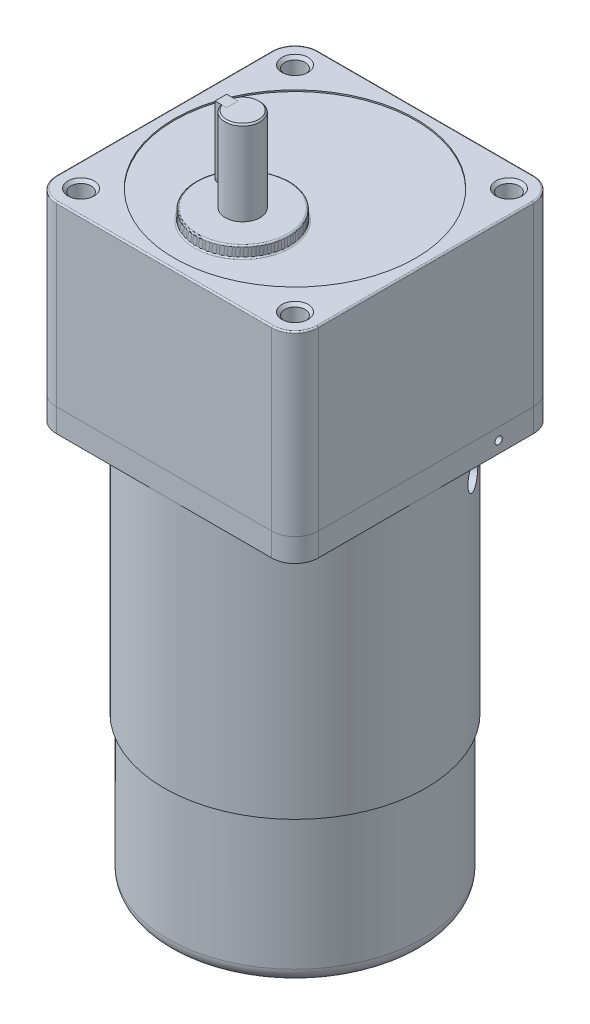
ISO-10303-21;
HEADER;
FILE_DESCRIPTION(('STEP AP214'),'2;1');
FILE_NAME('part.step','',(''),(''),'','','');
FILE_SCHEMA(('AUTOMOTIVE_DESIGN { 1 0 10303 214 1 1 1 1 }'));
ENDSEC;
DATA;
#1=APPLICATION_CONTEXT('core data for automotive mechanical design processes');
#2=APPLICATION_PROTOCOL_DEFINITION('international standard','automotive_design',2000,#1);
#3=PRODUCT_CONTEXT('',#1,'mechanical');
#4=PRODUCT('Part','Part','',(#3));
#5=PRODUCT_RELATED_PRODUCT_CATEGORY('part','',(#4));
#6=PRODUCT_DEFINITION_FORMATION('','',#4);
#7=PRODUCT_DEFINITION_CONTEXT('part definition',#1,'design');
#8=PRODUCT_DEFINITION('design','',#6,#7);
#9=PRODUCT_DEFINITION_SHAPE('','',#8);
#10=(LENGTH_UNIT() NAMED_UNIT(*) SI_UNIT(.MILLI.,.METRE.));
#11=(NAMED_UNIT(*) PLANE_ANGLE_UNIT() SI_UNIT($,.RADIAN.));
#12=(NAMED_UNIT(*) SI_UNIT($,.STERADIAN.) SOLID_ANGLE_UNIT());
#13=UNCERTAINTY_MEASURE_WITH_UNIT(LENGTH_MEASURE(1.E-05),#10,'distance_accuracy_value','');
#14=(GEOMETRIC_REPRESENTATION_CONTEXT(3) GLOBAL_UNCERTAINTY_ASSIGNED_CONTEXT((#13)) GLOBAL_UNIT_ASSIGNED_CONTEXT((#10,
#11,#12)) REPRESENTATION_CONTEXT('',''));
#15=CARTESIAN_POINT('',(0.,0.,0.));
#16=DIRECTION('',(0.,0.,1.));
#17=DIRECTION('',(1.,0.,0.));
#18=AXIS2_PLACEMENT_3D('',#15,#16,#17);
#19=CARTESIAN_POINT('',(-56.942,141.977781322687,18.0000000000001));
#20=DIRECTION('',(1.,0.,0.));
#21=DIRECTION('',(0.,0.,-1.));
#22=AXIS2_PLACEMENT_3D('',#19,#20,#21);
#23=CYLINDRICAL_SURFACE('',#22,2.00000000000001);
#24=CARTESIAN_POINT('',(-52.942,141.977781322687,18.0000000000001));
#25=DIRECTION('',(-1.,0.,0.));
#26=DIRECTION('',(0.,0.,1.));
#27=AXIS2_PLACEMENT_3D('',#24,#25,#26);
#28=CIRCLE('',#27,2.00000000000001);
#29=CARTESIAN_POINT('',(-52.942,141.977781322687,16.0000000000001));
#30=VERTEX_POINT('',#29);
#31=CARTESIAN_POINT('',(-52.942,141.977781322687,20.0000000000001));
#32=VERTEX_POINT('',#31);
#33=EDGE_CURVE('P0_E105',#30,#32,#28,.T.);
#34=ORIENTED_EDGE('',*,*,#33,.T.);
#35=DIRECTION('',(1.,0.,0.));
#36=VECTOR('',#35,1.);
#37=CARTESIAN_POINT('',(-56.942,141.977781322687,20.0000000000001));
#38=LINE('',#37,#36);
#39=CARTESIAN_POINT('',(-56.942,141.977781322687,20.0000000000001));
#40=VERTEX_POINT('',#39);
#41=EDGE_CURVE('P0_E12',#40,#32,#38,.T.);
#42=ORIENTED_EDGE('',*,*,#41,.F.);
#43=CARTESIAN_POINT('',(-56.942,141.977781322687,18.0000000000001));
#44=DIRECTION('',(-1.,0.,0.));
#45=DIRECTION('',(0.,0.,1.));
#46=AXIS2_PLACEMENT_3D('',#43,#44,#45);
#47=CIRCLE('',#46,2.00000000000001);
#48=CARTESIAN_POINT('',(-56.942,141.977781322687,16.0000000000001));
#49=VERTEX_POINT('',#48);
#50=EDGE_CURVE('P0_E93',#49,#40,#47,.T.);
#51=ORIENTED_EDGE('',*,*,#50,.F.);
#52=DIRECTION('',(1.,0.,0.));
#53=VECTOR('',#52,1.);
#54=CARTESIAN_POINT('',(-56.942,141.977781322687,16.0000000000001));
#55=LINE('',#54,#53);
#56=EDGE_CURVE('P0_E101',#49,#30,#55,.T.);
#57=ORIENTED_EDGE('',*,*,#56,.T.);
#58=EDGE_LOOP('',(#34,#42,#51,#57));
#59=FACE_BOUND('',#58,.T.);
#60=ADVANCED_FACE('P0_F42',(#59),#23,.T.);
#61=CARTESIAN_POINT('',(-56.942,164.977781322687,20.0000000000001));
#62=DIRECTION('',(0.,0.,-1.));
#63=DIRECTION('',(0.,1.,0.));
#64=AXIS2_PLACEMENT_3D('',#61,#62,#63);
#65=PLANE('',#64);
#66=DIRECTION('',(0.,1.,0.));
#67=VECTOR('',#66,1.);
#68=CARTESIAN_POINT('',(-52.942,164.977781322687,20.0000000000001));
#69=LINE('',#68,#67);
#70=CARTESIAN_POINT('',(-52.942,164.977781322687,20.0000000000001));
#71=VERTEX_POINT('',#70);
#72=EDGE_CURVE('P0_E97',#32,#71,#69,.T.);
#73=ORIENTED_EDGE('',*,*,#72,.T.);
#74=DIRECTION('',(1.,0.,0.));
#75=VECTOR('',#74,1.);
#76=CARTESIAN_POINT('',(-56.942,164.977781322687,20.0000000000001));
#77=LINE('',#76,#75);
#78=CARTESIAN_POINT('',(-56.942,164.977781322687,20.0000000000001));
#79=VERTEX_POINT('',#78);
#80=EDGE_CURVE('P0_E50',#79,#71,#77,.T.);
#81=ORIENTED_EDGE('',*,*,#80,.F.);
#82=DIRECTION('',(0.,1.,0.));
#83=VECTOR('',#82,1.);
#84=CARTESIAN_POINT('',(-56.942,164.977781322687,20.0000000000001));
#85=LINE('',#84,#83);
#86=EDGE_CURVE('P0_E88',#40,#79,#85,.T.);
#87=ORIENTED_EDGE('',*,*,#86,.F.);
#88=ORIENTED_EDGE('',*,*,#41,.T.);
#89=EDGE_LOOP('',(#73,#81,#87,#88));
#90=FACE_BOUND('',#89,.T.);
#91=ADVANCED_FACE('P0_F96',(#90),#65,.F.);
#92=CARTESIAN_POINT('',(-56.942,164.977781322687,16.0000000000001));
#93=DIRECTION('',(0.,-1.,0.));
#94=DIRECTION('',(0.,0.,-1.));
#95=AXIS2_PLACEMENT_3D('',#92,#93,#94);
#96=PLANE('',#95);
#97=DIRECTION('',(0.,0.,-1.));
#98=VECTOR('',#97,1.);
#99=CARTESIAN_POINT('',(-52.942,164.977781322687,16.0000000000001));
#100=LINE('',#99,#98);
#101=CARTESIAN_POINT('',(-52.942,164.977781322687,16.0000000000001));
#102=VERTEX_POINT('',#101);
#103=EDGE_CURVE('P0_E75',#71,#102,#100,.T.);
#104=ORIENTED_EDGE('',*,*,#103,.T.);
#105=DIRECTION('',(1.,0.,0.));
#106=VECTOR('',#105,1.);
#107=CARTESIAN_POINT('',(-56.942,164.977781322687,16.0000000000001));
#108=LINE('',#107,#106);
#109=CARTESIAN_POINT('',(-56.942,164.977781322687,16.0000000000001));
#110=VERTEX_POINT('',#109);
#111=EDGE_CURVE('P0_E98',#110,#102,#108,.T.);
#112=ORIENTED_EDGE('',*,*,#111,.F.);
#113=DIRECTION('',(0.,0.,-1.));
#114=VECTOR('',#113,1.);
#115=CARTESIAN_POINT('',(-56.942,164.977781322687,16.0000000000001));
#116=LINE('',#115,#114);
#117=EDGE_CURVE('P0_E91',#79,#110,#116,.T.);
#118=ORIENTED_EDGE('',*,*,#117,.F.);
#119=ORIENTED_EDGE('',*,*,#80,.T.);
#120=EDGE_LOOP('',(#104,#112,#118,#119));
#121=FACE_BOUND('',#120,.T.);
#122=ADVANCED_FACE('P0_F99',(#121),#96,.F.);
#123=CARTESIAN_POINT('',(-56.942,141.977781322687,16.0000000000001));
#124=DIRECTION('',(0.,0.,1.));
#125=DIRECTION('',(0.,-1.,0.));
#126=AXIS2_PLACEMENT_3D('',#123,#124,#125);
#127=PLANE('',#126);
#128=DIRECTION('',(0.,-1.,0.));
#129=VECTOR('',#128,1.);
#130=CARTESIAN_POINT('',(-52.942,141.977781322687,16.0000000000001));
#131=LINE('',#130,#129);
#132=EDGE_CURVE('P0_E81',#102,#30,#131,.T.);
#133=ORIENTED_EDGE('',*,*,#132,.T.);
#134=ORIENTED_EDGE('',*,*,#56,.F.);
#135=DIRECTION('',(0.,-1.,0.));
#136=VECTOR('',#135,1.);
#137=CARTESIAN_POINT('',(-56.942,141.977781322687,16.0000000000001));
#138=LINE('',#137,#136);
#139=EDGE_CURVE('P0_E58',#110,#49,#138,.T.);
#140=ORIENTED_EDGE('',*,*,#139,.F.);
#141=ORIENTED_EDGE('',*,*,#111,.T.);
#142=EDGE_LOOP('',(#133,#134,#140,#141));
#143=FACE_BOUND('',#142,.T.);
#144=ADVANCED_FACE('P0_F112',(#143),#127,.F.);
#145=CARTESIAN_POINT('',(-56.942,141.977781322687,18.0000000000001));
#146=DIRECTION('',(-1.,0.,0.));
#147=DIRECTION('',(0.,0.,1.));
#148=AXIS2_PLACEMENT_3D('',#145,#146,#147);
#149=PLANE('',#148);
#150=ORIENTED_EDGE('',*,*,#50,.T.);
#151=ORIENTED_EDGE('',*,*,#86,.T.);
#152=ORIENTED_EDGE('',*,*,#117,.T.);
#153=ORIENTED_EDGE('',*,*,#139,.T.);
#154=EDGE_LOOP('',(#150,#151,#152,#153));
#155=FACE_BOUND('',#154,.T.);
#156=ADVANCED_FACE('P0_F89',(#155),#149,.T.);
#157=CARTESIAN_POINT('',(-52.942,141.977781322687,18.0000000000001));
#158=DIRECTION('',(-1.,0.,0.));
#159=DIRECTION('',(0.,0.,1.));
#160=AXIS2_PLACEMENT_3D('',#157,#158,#159);
#161=PLANE('',#160);
#162=ORIENTED_EDGE('',*,*,#33,.F.);
#163=ORIENTED_EDGE('',*,*,#132,.F.);
#164=ORIENTED_EDGE('',*,*,#103,.F.);
#165=ORIENTED_EDGE('',*,*,#72,.F.);
#166=EDGE_LOOP('',(#162,#163,#164,#165));
#167=FACE_BOUND('',#166,.T.);
#168=ADVANCED_FACE('P0_F115',(#167),#161,.F.);
#169=CLOSED_SHELL('',(#60,#91,#122,#144,#156,#168));
#170=MANIFOLD_SOLID_BREP('P0_B2',#169);
#171=CARTESIAN_POINT('',(-49.4411945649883,164.977781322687,18.0000000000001));
#172=DIRECTION('',(0.,-1.,0.));
#173=DIRECTION('',(1.,0.,0.));
#174=AXIS2_PLACEMENT_3D('',#171,#172,#173);
#175=CYLINDRICAL_SURFACE('',#174,6.);
#176=CARTESIAN_POINT('',(-49.4411945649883,135.977781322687,18.0000000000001));
#177=DIRECTION('',(0.,1.,0.));
#178=DIRECTION('',(-1.,0.,0.));
#179=AXIS2_PLACEMENT_3D('',#176,#177,#178);
#180=CIRCLE('',#179,6.);
#181=CARTESIAN_POINT('',(-55.4411945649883,135.977781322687,18.0000000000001));
#182=VERTEX_POINT('',#181);
#183=EDGE_CURVE('P0_E242',#182,#182,#180,.T.);
#184=ORIENTED_EDGE('',*,*,#183,.T.);
#185=EDGE_LOOP('',(#184));
#186=FACE_BOUND('',#185,.T.);
#187=DIRECTION('',(0.,-1.,0.));
#188=VECTOR('',#187,1.);
#189=CARTESIAN_POINT('',(-55.0980488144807,164.977781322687,16.0000000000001));
#190=LINE('',#189,#188);
#191=CARTESIAN_POINT('',(-55.0980488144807,164.477781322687,16.0000000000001));
#192=VERTEX_POINT('',#191);
#193=CARTESIAN_POINT('',(-55.0980488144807,141.977781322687,16.0000000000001));
#194=VERTEX_POINT('',#193);
#195=EDGE_CURVE('P0_E232',#192,#194,#190,.T.);
#196=ORIENTED_EDGE('',*,*,#195,.F.);
#197=CARTESIAN_POINT('',(-49.4411945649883,164.477781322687,18.0000000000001));
#198=DIRECTION('',(0.,1.,0.));
#199=DIRECTION('',(0.,0.,1.));
#200=AXIS2_PLACEMENT_3D('',#197,#198,#199);
#201=CIRCLE('',#200,6.);
#202=CARTESIAN_POINT('',(-55.0980488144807,164.477781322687,20.0000000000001));
#203=VERTEX_POINT('',#202);
#204=EDGE_CURVE('P0_E180',#192,#203,#201,.F.);
#205=ORIENTED_EDGE('',*,*,#204,.T.);
#206=DIRECTION('',(0.,-1.,0.));
#207=VECTOR('',#206,1.);
#208=CARTESIAN_POINT('',(-55.0980488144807,164.977781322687,20.0000000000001));
#209=LINE('',#208,#207);
#210=CARTESIAN_POINT('',(-55.0980488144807,141.977781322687,20.0000000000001));
#211=VERTEX_POINT('',#210);
#212=EDGE_CURVE('P0_E233',#211,#203,#209,.F.);
#213=ORIENTED_EDGE('',*,*,#212,.F.);
#214=CARTESIAN_POINT('',(-55.0980488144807,141.977781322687,16.0000000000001));
#215=CARTESIAN_POINT('',(-55.0980434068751,141.923200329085,15.9999985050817));
#216=CARTESIAN_POINT('',(-55.0988397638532,141.868647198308,16.0022357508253));
#217=CARTESIAN_POINT('',(-55.1019811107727,141.759964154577,16.0111487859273));
#218=CARTESIAN_POINT('',(-55.1043256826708,141.705834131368,16.0178233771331));
#219=CARTESIAN_POINT('',(-55.1135764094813,141.544997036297,16.0443786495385));
#220=CARTESIAN_POINT('',(-55.1227004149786,141.439419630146,16.0707915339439));
#221=CARTESIAN_POINT('',(-55.1457560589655,141.234530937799,16.1400831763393));
#222=CARTESIAN_POINT('',(-55.1596850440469,141.135216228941,16.1829528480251));
#223=CARTESIAN_POINT('',(-55.1907703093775,140.945101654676,16.2838535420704));
#224=CARTESIAN_POINT('',(-55.2079285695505,140.854307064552,16.3418938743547));
#225=CARTESIAN_POINT('',(-55.2442841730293,140.680340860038,16.4738972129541));
#226=CARTESIAN_POINT('',(-55.2635321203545,140.597551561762,16.548350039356));
#227=CARTESIAN_POINT('',(-55.3014715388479,140.445369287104,16.7100231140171));
#228=CARTESIAN_POINT('',(-55.3201629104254,140.375978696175,16.7972456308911));
#229=CARTESIAN_POINT('',(-55.3554722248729,140.250822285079,16.9847927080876));
#230=CARTESIAN_POINT('',(-55.3720233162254,140.195459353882,17.0853998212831));
#231=CARTESIAN_POINT('',(-55.4005867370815,140.102596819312,17.2951415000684));
#232=CARTESIAN_POINT('',(-55.4126004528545,140.065091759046,17.4042734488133));
#233=CARTESIAN_POINT('',(-55.4303759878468,140.010309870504,17.623941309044));
#234=CARTESIAN_POINT('',(-55.4363407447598,139.99237477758,17.7342963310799));
#235=CARTESIAN_POINT('',(-55.4420667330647,139.975148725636,17.9566020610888));
#236=CARTESIAN_POINT('',(-55.4418294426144,139.975853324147,18.0685523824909));
#237=CARTESIAN_POINT('',(-55.4353153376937,139.9954698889,18.2862076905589));
#238=CARTESIAN_POINT('',(-55.4292757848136,140.013666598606,18.3919854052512));
#239=CARTESIAN_POINT('',(-55.4121337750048,140.066567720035,18.5988881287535));
#240=CARTESIAN_POINT('',(-55.401031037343,140.101273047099,18.7000128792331));
#241=CARTESIAN_POINT('',(-55.3747079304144,140.186624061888,18.8963052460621));
#242=CARTESIAN_POINT('',(-55.3594353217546,140.237473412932,18.9913770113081));
#243=CARTESIAN_POINT('',(-55.3263623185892,140.353501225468,19.1718491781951));
#244=CARTESIAN_POINT('',(-55.3085612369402,140.41868358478,19.2572469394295));
#245=CARTESIAN_POINT('',(-55.2713200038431,140.565123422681,19.4201946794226));
#246=CARTESIAN_POINT('',(-55.2518421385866,140.646992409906,19.4971872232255));
#247=CARTESIAN_POINT('',(-55.2141443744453,140.822664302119,19.6365440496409));
#248=CARTESIAN_POINT('',(-55.1959248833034,140.916471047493,19.6989036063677));
#249=CARTESIAN_POINT('',(-55.1625951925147,141.115141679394,19.8080066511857));
#250=CARTESIAN_POINT('',(-55.147534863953,141.220148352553,19.8545060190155));
#251=CARTESIAN_POINT('',(-55.1228165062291,141.437075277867,19.9289204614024));
#252=CARTESIAN_POINT('',(-55.1131499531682,141.548984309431,19.9568648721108));
#253=CARTESIAN_POINT('',(-55.1039254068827,141.714618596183,19.9833163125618));
#254=CARTESIAN_POINT('',(-55.1017279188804,141.767064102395,19.9895701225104));
#255=CARTESIAN_POINT('',(-55.0987886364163,141.872257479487,19.9979092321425));
#256=CARTESIAN_POINT('',(-55.0980449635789,141.925004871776,19.9999999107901));
#257=CARTESIAN_POINT('',(-55.0980488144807,141.977781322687,20.0000000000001));
#258=B_SPLINE_CURVE_WITH_KNOTS('',3,(#214,#215,#216,#217,#218,#219,#220,#221,#222,#223,#224,
#225,#226,#227,#228,#229,#230,#231,#232,#233,#234,#235,#236,#237,#238,#239,#240,#241,#242,#243,
#244,#245,#246,#247,#248,#249,#250,#251,#252,#253,#254,#255,#256,#257),.UNSPECIFIED.,.F.,.F.,(4,
2,2,2,2,2,2,2,2,2,2,2,2,2,2,2,2,2,2,2,2,4),(0.,0.163636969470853,0.327229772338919,
0.653162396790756,0.978915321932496,1.30486862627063,1.64233009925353,1.97985159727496,
2.32618265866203,2.67240782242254,3.00658941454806,3.34069136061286,3.66168836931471,
3.98270317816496,4.30794037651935,4.63326613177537,4.97388108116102,5.31460588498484,
5.66036059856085,6.0055673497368,6.16399790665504,6.32222363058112),.UNSPECIFIED.);
#259=EDGE_CURVE('P0_E248',#194,#211,#258,.T.);
#260=ORIENTED_EDGE('',*,*,#259,.F.);
#261=EDGE_LOOP('',(#196,#205,#213,#260));
#262=FACE_BOUND('',#261,.T.);
#263=ADVANCED_FACE('P0_F165',(#186,#262),#175,.T.);
#264=CARTESIAN_POINT('',(-49.4411945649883,164.977781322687,18.0000000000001));
#265=DIRECTION('',(0.,1.,0.));
#266=DIRECTION('',(-1.,0.,0.));
#267=AXIS2_PLACEMENT_3D('',#264,#265,#266);
#268=PLANE('',#267);
#269=DIRECTION('',(-1.,0.,0.));
#270=VECTOR('',#269,1.);
#271=CARTESIAN_POINT('',(-52.942,164.977781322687,20.0000000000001));
#272=LINE('',#271,#270);
#273=CARTESIAN_POINT('',(-52.942,164.977781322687,20.0000000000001));
#274=VERTEX_POINT('',#273);
#275=CARTESIAN_POINT('',(-54.5646699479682,164.977781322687,20.0000000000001));
#276=VERTEX_POINT('',#275);
#277=EDGE_CURVE('P0_E237',#274,#276,#272,.T.);
#278=ORIENTED_EDGE('',*,*,#277,.T.);
#279=CARTESIAN_POINT('',(-49.4411945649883,164.977781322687,18.0000000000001));
#280=DIRECTION('',(0.,1.,0.));
#281=DIRECTION('',(-1.,0.,0.));
#282=AXIS2_PLACEMENT_3D('',#279,#280,#281);
#283=CIRCLE('',#282,5.50000000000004);
#284=CARTESIAN_POINT('',(-54.5646699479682,164.977781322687,16.0000000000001));
#285=VERTEX_POINT('',#284);
#286=EDGE_CURVE('P0_E255',#276,#285,#283,.T.);
#287=ORIENTED_EDGE('',*,*,#286,.T.);
#288=DIRECTION('',(-1.,0.,0.));
#289=VECTOR('',#288,1.);
#290=CARTESIAN_POINT('',(-52.942,164.977781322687,16.0000000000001));
#291=LINE('',#290,#289);
#292=CARTESIAN_POINT('',(-52.942,164.977781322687,16.0000000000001));
#293=VERTEX_POINT('',#292);
#294=EDGE_CURVE('P0_E234',#293,#285,#291,.T.);
#295=ORIENTED_EDGE('',*,*,#294,.F.);
#296=DIRECTION('',(0.,0.,1.));
#297=VECTOR('',#296,1.);
#298=CARTESIAN_POINT('',(-52.942,164.977781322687,16.0000000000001));
#299=LINE('',#298,#297);
#300=EDGE_CURVE('P0_E218',#293,#274,#299,.T.);
#301=ORIENTED_EDGE('',*,*,#300,.T.);
#302=EDGE_LOOP('',(#278,#287,#295,#301));
#303=FACE_BOUND('',#302,.T.);
#304=ADVANCED_FACE('P0_F266',(#303),#268,.T.);
#305=CARTESIAN_POINT('',(-49.4411945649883,135.977781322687,18.0000000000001));
#306=DIRECTION('',(0.,1.,0.));
#307=DIRECTION('',(-1.,0.,0.));
#308=AXIS2_PLACEMENT_3D('',#305,#306,#307);
#309=PLANE('',#308);
#310=CARTESIAN_POINT('',(-49.4411945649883,135.977781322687,18.0000000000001));
#311=DIRECTION('',(0.,1.,0.));
#312=DIRECTION('',(-1.,0.,0.));
#313=AXIS2_PLACEMENT_3D('',#310,#311,#312);
#314=CIRCLE('',#313,15.5);
#315=CARTESIAN_POINT('',(-64.9411945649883,135.977781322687,18.0000000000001));
#316=VERTEX_POINT('',#315);
#317=EDGE_CURVE('P0_E173',#316,#316,#314,.T.);
#318=ORIENTED_EDGE('',*,*,#317,.T.);
#319=EDGE_LOOP('',(#318));
#320=FACE_BOUND('',#319,.T.);
#321=ORIENTED_EDGE('',*,*,#183,.F.);
#322=EDGE_LOOP('',(#321));
#323=FACE_BOUND('',#322,.T.);
#324=ADVANCED_FACE('P0_F268',(#320,#323),#309,.T.);
#325=CARTESIAN_POINT('',(-49.4411945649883,135.977781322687,18.0000000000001));
#326=DIRECTION('',(0.,-1.,0.));
#327=DIRECTION('',(1.,0.,0.));
#328=AXIS2_PLACEMENT_3D('',#325,#326,#327);
#329=CYLINDRICAL_SURFACE('',#328,16.);
#330=CARTESIAN_POINT('',(-49.4411945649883,135.477781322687,18.0000000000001));
#331=DIRECTION('',(0.,1.,0.));
#332=DIRECTION('',(-1.,0.,0.));
#333=AXIS2_PLACEMENT_3D('',#330,#331,#332);
#334=CIRCLE('',#333,16.);
#335=CARTESIAN_POINT('',(-33.4411945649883,135.477781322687,18.0000000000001));
#336=VERTEX_POINT('',#335);
#337=EDGE_CURVE('P0_E40',#336,#336,#334,.F.);
#338=CARTESIAN_POINT('',(-49.4411945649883,132.177781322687,18.0000000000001));
#339=DIRECTION('',(0.,1.,0.));
#340=DIRECTION('',(-1.,0.,0.));
#341=AXIS2_PLACEMENT_3D('',#338,#339,#340);
#342=CIRCLE('',#341,16.);
#343=CARTESIAN_POINT('',(-33.4411945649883,132.177781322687,18.0000000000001));
#344=VERTEX_POINT('',#343);
#345=EDGE_CURVE('P0_E245',#344,#344,#342,.T.);
#346=CARTESIAN_POINT('',(-33.4411945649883,135.477781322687,18.0000000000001));
#347=CARTESIAN_POINT('',(-33.4411945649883,135.443406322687,18.0000000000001));
#348=CARTESIAN_POINT('',(-33.4411945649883,135.409031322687,18.0000000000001));
#349=CARTESIAN_POINT('',(-33.4411945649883,135.340281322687,18.0000000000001));
#350=CARTESIAN_POINT('',(-33.4411945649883,135.305906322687,18.0000000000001));
#351=CARTESIAN_POINT('',(-33.4411945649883,135.237156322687,18.0000000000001));
#352=CARTESIAN_POINT('',(-33.4411945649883,135.202781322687,18.0000000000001));
#353=CARTESIAN_POINT('',(-33.4411945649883,135.134031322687,18.0000000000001));
#354=CARTESIAN_POINT('',(-33.4411945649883,135.099656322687,18.0000000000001));
#355=CARTESIAN_POINT('',(-33.4411945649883,135.030906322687,18.0000000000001));
#356=CARTESIAN_POINT('',(-33.4411945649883,134.996531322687,18.0000000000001));
#357=CARTESIAN_POINT('',(-33.4411945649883,134.927781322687,18.0000000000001));
#358=CARTESIAN_POINT('',(-33.4411945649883,134.893406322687,18.0000000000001));
#359=CARTESIAN_POINT('',(-33.4411945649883,134.824656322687,18.0000000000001));
#360=CARTESIAN_POINT('',(-33.4411945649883,134.790281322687,18.0000000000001));
#361=CARTESIAN_POINT('',(-33.4411945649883,134.721531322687,18.0000000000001));
#362=CARTESIAN_POINT('',(-33.4411945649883,134.687156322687,18.0000000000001));
#363=CARTESIAN_POINT('',(-33.4411945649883,134.618406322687,18.0000000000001));
#364=CARTESIAN_POINT('',(-33.4411945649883,134.584031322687,18.0000000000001));
#365=CARTESIAN_POINT('',(-33.4411945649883,134.515281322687,18.0000000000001));
#366=CARTESIAN_POINT('',(-33.4411945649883,134.480906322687,18.0000000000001));
#367=CARTESIAN_POINT('',(-33.4411945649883,134.412156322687,18.0000000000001));
#368=CARTESIAN_POINT('',(-33.4411945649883,134.377781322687,18.0000000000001));
#369=CARTESIAN_POINT('',(-33.4411945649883,134.309031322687,18.0000000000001));
#370=CARTESIAN_POINT('',(-33.4411945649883,134.274656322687,18.0000000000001));
#371=CARTESIAN_POINT('',(-33.4411945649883,134.205906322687,18.0000000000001));
#372=CARTESIAN_POINT('',(-33.4411945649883,134.171531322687,18.0000000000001));
#373=CARTESIAN_POINT('',(-33.4411945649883,134.102781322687,18.0000000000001));
#374=CARTESIAN_POINT('',(-33.4411945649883,134.068406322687,18.0000000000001));
#375=CARTESIAN_POINT('',(-33.4411945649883,133.999656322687,18.0000000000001));
#376=CARTESIAN_POINT('',(-33.4411945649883,133.965281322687,18.0000000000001));
#377=CARTESIAN_POINT('',(-33.4411945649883,133.896531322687,18.0000000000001));
#378=CARTESIAN_POINT('',(-33.4411945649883,133.862156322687,18.0000000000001));
#379=CARTESIAN_POINT('',(-33.4411945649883,133.793406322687,18.0000000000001));
#380=CARTESIAN_POINT('',(-33.4411945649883,133.759031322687,18.0000000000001));
#381=CARTESIAN_POINT('',(-33.4411945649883,133.690281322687,18.0000000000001));
#382=CARTESIAN_POINT('',(-33.4411945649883,133.655906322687,18.0000000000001));
#383=CARTESIAN_POINT('',(-33.4411945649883,133.587156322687,18.0000000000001));
#384=CARTESIAN_POINT('',(-33.4411945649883,133.552781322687,18.0000000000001));
#385=CARTESIAN_POINT('',(-33.4411945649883,133.484031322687,18.0000000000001));
#386=CARTESIAN_POINT('',(-33.4411945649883,133.449656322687,18.0000000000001));
#387=CARTESIAN_POINT('',(-33.4411945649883,133.380906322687,18.0000000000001));
#388=CARTESIAN_POINT('',(-33.4411945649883,133.346531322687,18.0000000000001));
#389=CARTESIAN_POINT('',(-33.4411945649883,133.277781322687,18.0000000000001));
#390=CARTESIAN_POINT('',(-33.4411945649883,133.243406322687,18.0000000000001));
#391=CARTESIAN_POINT('',(-33.4411945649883,133.174656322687,18.0000000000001));
#392=CARTESIAN_POINT('',(-33.4411945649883,133.140281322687,18.0000000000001));
#393=CARTESIAN_POINT('',(-33.4411945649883,133.071531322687,18.0000000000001));
#394=CARTESIAN_POINT('',(-33.4411945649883,133.037156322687,18.0000000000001));
#395=CARTESIAN_POINT('',(-33.4411945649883,132.968406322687,18.0000000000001));
#396=CARTESIAN_POINT('',(-33.4411945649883,132.934031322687,18.0000000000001));
#397=CARTESIAN_POINT('',(-33.4411945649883,132.865281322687,18.0000000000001));
#398=CARTESIAN_POINT('',(-33.4411945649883,132.830906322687,18.0000000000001));
#399=CARTESIAN_POINT('',(-33.4411945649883,132.762156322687,18.0000000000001));
#400=CARTESIAN_POINT('',(-33.4411945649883,132.727781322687,18.0000000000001));
#401=CARTESIAN_POINT('',(-33.4411945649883,132.659031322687,18.0000000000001));
#402=CARTESIAN_POINT('',(-33.4411945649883,132.624656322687,18.0000000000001));
#403=CARTESIAN_POINT('',(-33.4411945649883,132.555906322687,18.0000000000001));
#404=CARTESIAN_POINT('',(-33.4411945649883,132.521531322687,18.0000000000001));
#405=CARTESIAN_POINT('',(-33.4411945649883,132.452781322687,18.0000000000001));
#406=CARTESIAN_POINT('',(-33.4411945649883,132.418406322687,18.0000000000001));
#407=CARTESIAN_POINT('',(-33.4411945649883,132.349656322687,18.0000000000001));
#408=CARTESIAN_POINT('',(-33.4411945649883,132.315281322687,18.0000000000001));
#409=CARTESIAN_POINT('',(-33.4411945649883,132.246531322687,18.0000000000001));
#410=CARTESIAN_POINT('',(-33.4411945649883,132.212156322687,18.0000000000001));
#411=CARTESIAN_POINT('',(-33.4411945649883,132.177781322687,18.0000000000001));
#412=B_SPLINE_CURVE_WITH_KNOTS('',3,(#346,#347,#348,#349,#350,#351,#352,#353,#354,#355,#356,
#357,#358,#359,#360,#361,#362,#363,#364,#365,#366,#367,#368,#369,#370,#371,#372,#373,#374,#375,
#376,#377,#378,#379,#380,#381,#382,#383,#384,#385,#386,#387,#388,#389,#390,#391,#392,#393,#394,
#395,#396,#397,#398,#399,#400,#401,#402,#403,#404,#405,#406,#407,#408,#409,#410,#411),
.UNSPECIFIED.,.F.,.F.,(4,2,2,2,2,2,2,2,2,2,2,2,2,2,2,2,2,2,2,2,2,2,2,2,2,2,2,2,2,2,2,2,4),(0.,
0.103124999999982,0.206249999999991,0.309374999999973,0.412499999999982,0.515624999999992,
0.618749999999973,0.721874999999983,0.824999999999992,0.928124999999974,1.03124999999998,
1.13437499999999,1.23749999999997,1.34062499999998,1.44374999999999,1.54687499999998,
1.64999999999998,1.75312499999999,1.85624999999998,1.95937499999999,2.06249999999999,
2.16562499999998,2.26874999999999,2.371875,2.47499999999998,2.57812499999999,2.68125,
2.78437499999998,2.88749999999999,2.990625,3.09374999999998,3.19687499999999,3.29999999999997),.UNSPECIFIED.);
#413=EDGE_CURVE('P0_BSEAM274',#336,#344,#412,.T.);
#414=ORIENTED_EDGE('',*,*,#337,.T.);
#415=ORIENTED_EDGE('',*,*,#345,.T.);
#416=ORIENTED_EDGE('',*,*,#413,.T.);
#417=ORIENTED_EDGE('',*,*,#413,.F.);
#418=EDGE_LOOP('',(#414,#416,#415,#417));
#419=FACE_BOUND('',#418,.T.);
#420=ADVANCED_FACE('P0_F274',(#419),#329,.T.);
#421=CARTESIAN_POINT('',(-49.4411945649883,132.177781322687,18.0000000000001));
#422=DIRECTION('',(0.,1.,0.));
#423=DIRECTION('',(-1.,0.,0.));
#424=AXIS2_PLACEMENT_3D('',#421,#422,#423);
#425=PLANE('',#424);
#426=ORIENTED_EDGE('',*,*,#345,.F.);
#427=EDGE_LOOP('',(#426));
#428=FACE_BOUND('',#427,.T.);
#429=ADVANCED_FACE('P0_F263',(#428),#425,.F.);
#430=CARTESIAN_POINT('',(-52.942,141.977781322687,18.0000000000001));
#431=DIRECTION('',(-1.,0.,0.));
#432=DIRECTION('',(0.,0.,1.));
#433=AXIS2_PLACEMENT_3D('',#430,#431,#432);
#434=CYLINDRICAL_SURFACE('',#433,2.);
#435=ORIENTED_EDGE('',*,*,#259,.T.);
#436=DIRECTION('',(-1.,0.,0.));
#437=VECTOR('',#436,1.);
#438=CARTESIAN_POINT('',(-52.942,141.977781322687,20.0000000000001));
#439=LINE('',#438,#437);
#440=CARTESIAN_POINT('',(-52.942,141.977781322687,20.0000000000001));
#441=VERTEX_POINT('',#440);
#442=EDGE_CURVE('P0_E229',#441,#211,#439,.T.);
#443=ORIENTED_EDGE('',*,*,#442,.F.);
#444=CARTESIAN_POINT('',(-52.942,141.977781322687,18.0000000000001));
#445=DIRECTION('',(1.,0.,0.));
#446=DIRECTION('',(0.,0.,-1.));
#447=AXIS2_PLACEMENT_3D('',#444,#445,#446);
#448=CIRCLE('',#447,2.);
#449=CARTESIAN_POINT('',(-52.942,141.977781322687,16.0000000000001));
#450=VERTEX_POINT('',#449);
#451=EDGE_CURVE('P0_E216',#441,#450,#448,.T.);
#452=ORIENTED_EDGE('',*,*,#451,.T.);
#453=DIRECTION('',(-1.,0.,0.));
#454=VECTOR('',#453,1.);
#455=CARTESIAN_POINT('',(-52.942,141.977781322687,16.0000000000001));
#456=LINE('',#455,#454);
#457=EDGE_CURVE('P0_E226',#450,#194,#456,.T.);
#458=ORIENTED_EDGE('',*,*,#457,.T.);
#459=EDGE_LOOP('',(#435,#443,#452,#458));
#460=FACE_BOUND('',#459,.T.);
#461=ADVANCED_FACE('P0_F225',(#460),#434,.F.);
#462=CARTESIAN_POINT('',(-52.942,141.977781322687,16.0000000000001));
#463=DIRECTION('',(0.,0.,1.));
#464=DIRECTION('',(1.,0.,0.));
#465=AXIS2_PLACEMENT_3D('',#462,#463,#464);
#466=PLANE('',#465);
#467=ORIENTED_EDGE('',*,*,#294,.T.);
#468=CARTESIAN_POINT('',(-54.5646699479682,164.977781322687,16.0000000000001));
#469=CARTESIAN_POINT('',(-54.6538158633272,164.894714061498,16.0000000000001));
#470=CARTESIAN_POINT('',(-54.7428370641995,164.811513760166,16.0000000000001));
#471=CARTESIAN_POINT('',(-54.9206300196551,164.644847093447,16.0000000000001));
#472=CARTESIAN_POINT('',(-55.009401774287,164.561380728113,16.0000000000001));
#473=CARTESIAN_POINT('',(-55.0980488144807,164.477781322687,16.0000000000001));
#474=B_SPLINE_CURVE_WITH_KNOTS('',3,(#468,#469,#470,#471,#472,#473),.UNSPECIFIED.,.F.,.F.,(4,2,
4),(0.,0.365545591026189,0.731091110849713),.UNSPECIFIED.);
#475=EDGE_CURVE('P0_E188',#285,#192,#474,.T.);
#476=ORIENTED_EDGE('',*,*,#475,.T.);
#477=ORIENTED_EDGE('',*,*,#195,.T.);
#478=ORIENTED_EDGE('',*,*,#457,.F.);
#479=DIRECTION('',(0.,1.,0.));
#480=VECTOR('',#479,1.);
#481=CARTESIAN_POINT('',(-52.942,141.977781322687,16.0000000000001));
#482=LINE('',#481,#480);
#483=EDGE_CURVE('P0_E213',#450,#293,#482,.T.);
#484=ORIENTED_EDGE('',*,*,#483,.T.);
#485=EDGE_LOOP('',(#467,#476,#477,#478,#484));
#486=FACE_BOUND('',#485,.T.);
#487=ADVANCED_FACE('P0_F231',(#486),#466,.T.);
#488=CARTESIAN_POINT('',(-52.942,164.977781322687,20.0000000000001));
#489=DIRECTION('',(0.,0.,-1.));
#490=DIRECTION('',(-1.,0.,0.));
#491=AXIS2_PLACEMENT_3D('',#488,#489,#490);
#492=PLANE('',#491);
#493=ORIENTED_EDGE('',*,*,#212,.T.);
#494=CARTESIAN_POINT('',(-55.0980488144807,164.477781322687,20.0000000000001));
#495=CARTESIAN_POINT('',(-55.009401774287,164.561380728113,20.0000000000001));
#496=CARTESIAN_POINT('',(-54.9206300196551,164.644847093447,20.0000000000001));
#497=CARTESIAN_POINT('',(-54.7428370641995,164.811513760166,20.0000000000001));
#498=CARTESIAN_POINT('',(-54.6538158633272,164.894714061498,20.0000000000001));
#499=CARTESIAN_POINT('',(-54.5646699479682,164.977781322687,20.0000000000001));
#500=B_SPLINE_CURVE_WITH_KNOTS('',3,(#494,#495,#496,#497,#498,#499),.UNSPECIFIED.,.F.,.F.,(4,2,
4),(0.,0.365545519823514,0.731091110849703),.UNSPECIFIED.);
#501=EDGE_CURVE('P0_E285',#203,#276,#500,.T.);
#502=ORIENTED_EDGE('',*,*,#501,.T.);
#503=ORIENTED_EDGE('',*,*,#277,.F.);
#504=DIRECTION('',(0.,-1.,0.));
#505=VECTOR('',#504,1.);
#506=CARTESIAN_POINT('',(-52.942,164.977781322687,20.0000000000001));
#507=LINE('',#506,#505);
#508=EDGE_CURVE('P0_E383',#274,#441,#507,.T.);
#509=ORIENTED_EDGE('',*,*,#508,.T.);
#510=ORIENTED_EDGE('',*,*,#442,.T.);
#511=EDGE_LOOP('',(#493,#502,#503,#509,#510));
#512=FACE_BOUND('',#511,.T.);
#513=ADVANCED_FACE('P0_F299',(#512),#492,.T.);
#514=CARTESIAN_POINT('',(-52.942,141.977781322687,18.0000000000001));
#515=DIRECTION('',(1.,0.,0.));
#516=DIRECTION('',(0.,0.,-1.));
#517=AXIS2_PLACEMENT_3D('',#514,#515,#516);
#518=PLANE('',#517);
#519=ORIENTED_EDGE('',*,*,#451,.F.);
#520=ORIENTED_EDGE('',*,*,#508,.F.);
#521=ORIENTED_EDGE('',*,*,#300,.F.);
#522=ORIENTED_EDGE('',*,*,#483,.F.);
#523=EDGE_LOOP('',(#519,#520,#521,#522));
#524=FACE_BOUND('',#523,.T.);
#525=ADVANCED_FACE('P0_F215',(#524),#518,.F.);
#526=CARTESIAN_POINT('',(-49.4411945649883,164.977781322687,18.0000000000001));
#527=DIRECTION('',(0.,-1.,0.));
#528=DIRECTION('',(0.,0.,-1.));
#529=AXIS2_PLACEMENT_3D('',#526,#527,#528);
#530=CONICAL_SURFACE('',#529,5.50000000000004,0.785398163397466);
#531=ORIENTED_EDGE('',*,*,#501,.F.);
#532=ORIENTED_EDGE('',*,*,#204,.F.);
#533=ORIENTED_EDGE('',*,*,#475,.F.);
#534=ORIENTED_EDGE('',*,*,#286,.F.);
#535=EDGE_LOOP('',(#531,#532,#533,#534));
#536=FACE_BOUND('',#535,.T.);
#537=ADVANCED_FACE('P0_F284',(#536),#530,.T.);
#538=CARTESIAN_POINT('',(-49.4411945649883,135.477781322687,18.0000000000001));
#539=DIRECTION('',(0.,1.,0.));
#540=DIRECTION('',(-1.,0.,0.));
#541=AXIS2_PLACEMENT_3D('',#538,#539,#540);
#542=TOROIDAL_SURFACE('',#541,15.5,0.5);
#543=ORIENTED_EDGE('',*,*,#337,.F.);
#544=EDGE_LOOP('',(#543));
#545=FACE_BOUND('',#544,.T.);
#546=ORIENTED_EDGE('',*,*,#317,.F.);
#547=EDGE_LOOP('',(#546));
#548=FACE_BOUND('',#547,.T.);
#549=ADVANCED_FACE('P0_F167',(#545,#548),#542,.T.);
#550=CLOSED_SHELL('',(#263,#304,#324,#420,#429,#461,#487,#513,#525,#537,#549));
#551=MANIFOLD_SOLID_BREP('P0_B6',#550);
#552=CARTESIAN_POINT('',(-49.4411945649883,135.877781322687,18.0000000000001));
#553=DIRECTION('',(0.,1.,0.));
#554=DIRECTION('',(-1.,0.,0.));
#555=AXIS2_PLACEMENT_3D('',#552,#553,#554);
#556=PLANE('',#555);
#557=CARTESIAN_POINT('',(-49.4411945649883,135.877781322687,18.0000000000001));
#558=DIRECTION('',(0.,1.,0.));
#559=DIRECTION('',(-1.,0.,0.));
#560=AXIS2_PLACEMENT_3D('',#557,#558,#559);
#561=CIRCLE('',#560,15.5);
#562=CARTESIAN_POINT('',(-64.9411945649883,135.877781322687,18.0000000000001));
#563=VERTEX_POINT('',#562);
#564=EDGE_CURVE('P1_E22',#563,#563,#561,.T.);
#565=ORIENTED_EDGE('',*,*,#564,.T.);
#566=EDGE_LOOP('',(#565));
#567=FACE_BOUND('',#566,.T.);
#568=CARTESIAN_POINT('',(-49.4411945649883,135.877781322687,18.0000000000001));
#569=DIRECTION('',(0.,-1.,0.));
#570=DIRECTION('',(1.,0.,0.));
#571=AXIS2_PLACEMENT_3D('',#568,#569,#570);
#572=CIRCLE('',#571,7.65);
#573=CARTESIAN_POINT('',(-41.7911945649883,135.877781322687,18.0000000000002));
#574=VERTEX_POINT('',#573);
#575=EDGE_CURVE('P1_E11',#574,#574,#572,.T.);
#576=ORIENTED_EDGE('',*,*,#575,.T.);
#577=EDGE_LOOP('',(#576));
#578=FACE_BOUND('',#577,.T.);
#579=ADVANCED_FACE('P1_F16',(#567,#578),#556,.T.);
#580=CARTESIAN_POINT('',(-49.4411945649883,135.377781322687,18.0000000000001));
#581=DIRECTION('',(0.,1.,0.));
#582=DIRECTION('',(-1.,0.,0.));
#583=AXIS2_PLACEMENT_3D('',#580,#581,#582);
#584=TOROIDAL_SURFACE('',#583,15.5,0.5);
#585=CARTESIAN_POINT('',(-49.4411945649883,135.377781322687,18.0000000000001));
#586=DIRECTION('',(0.,1.,0.));
#587=DIRECTION('',(-1.,0.,0.));
#588=AXIS2_PLACEMENT_3D('',#585,#586,#587);
#589=CIRCLE('',#588,16.);
#590=CARTESIAN_POINT('',(-65.4411945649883,135.377781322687,18.0000000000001));
#591=VERTEX_POINT('',#590);
#592=EDGE_CURVE('P1_E284',#591,#591,#589,.F.);
#593=ORIENTED_EDGE('',*,*,#592,.F.);
#594=EDGE_LOOP('',(#593));
#595=FACE_BOUND('',#594,.T.);
#596=ORIENTED_EDGE('',*,*,#564,.F.);
#597=EDGE_LOOP('',(#596));
#598=FACE_BOUND('',#597,.T.);
#599=ADVANCED_FACE('P1_F291',(#595,#598),#584,.T.);
#600=CARTESIAN_POINT('',(-49.4411945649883,135.877781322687,18.0000000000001));
#601=DIRECTION('',(0.,-1.,0.));
#602=DIRECTION('',(1.,0.,0.));
#603=AXIS2_PLACEMENT_3D('',#600,#601,#602);
#604=CYLINDRICAL_SURFACE('',#603,16.);
#605=CARTESIAN_POINT('',(-49.4411945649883,132.677781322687,18.0000000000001));
#606=DIRECTION('',(0.,1.,0.));
#607=DIRECTION('',(-1.,0.,0.));
#608=AXIS2_PLACEMENT_3D('',#605,#606,#607);
#609=CIRCLE('',#608,16.);
#610=CARTESIAN_POINT('',(-65.4411945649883,132.677781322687,18.0000000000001));
#611=VERTEX_POINT('',#610);
#612=EDGE_CURVE('P1_E281',#611,#611,#609,.T.);
#613=ORIENTED_EDGE('',*,*,#612,.T.);
#614=EDGE_LOOP('',(#613));
#615=FACE_BOUND('',#614,.T.);
#616=ORIENTED_EDGE('',*,*,#592,.T.);
#617=EDGE_LOOP('',(#616));
#618=FACE_BOUND('',#617,.T.);
#619=ADVANCED_FACE('P1_F293',(#615,#618),#604,.T.);
#620=CARTESIAN_POINT('',(-49.4411945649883,132.677781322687,18.0000000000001));
#621=DIRECTION('',(0.,1.,0.));
#622=DIRECTION('',(-1.,0.,0.));
#623=AXIS2_PLACEMENT_3D('',#620,#621,#622);
#624=TOROIDAL_SURFACE('',#623,16.5,0.5);
#625=CARTESIAN_POINT('',(-49.4411945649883,132.177781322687,18.0000000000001));
#626=DIRECTION('',(0.,1.,0.));
#627=DIRECTION('',(-1.,0.,0.));
#628=AXIS2_PLACEMENT_3D('',#625,#626,#627);
#629=CIRCLE('',#628,16.5);
#630=CARTESIAN_POINT('',(-65.9411945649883,132.177781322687,18.0000000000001));
#631=VERTEX_POINT('',#630);
#632=EDGE_CURVE('P1_E278',#631,#631,#629,.F.);
#633=ORIENTED_EDGE('',*,*,#632,.F.);
#634=EDGE_LOOP('',(#633));
#635=FACE_BOUND('',#634,.T.);
#636=ORIENTED_EDGE('',*,*,#612,.F.);
#637=EDGE_LOOP('',(#636));
#638=FACE_BOUND('',#637,.T.);
#639=ADVANCED_FACE('P1_F300',(#635,#638),#624,.F.);
#640=CARTESIAN_POINT('',(-49.4411945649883,132.177781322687,1.2490009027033E-13));
#641=DIRECTION('',(0.,1.,0.));
#642=DIRECTION('',(-1.,0.,0.));
#643=AXIS2_PLACEMENT_3D('',#640,#641,#642);
#644=PLANE('',#643);
#645=ORIENTED_EDGE('',*,*,#632,.T.);
#646=EDGE_LOOP('',(#645));
#647=FACE_BOUND('',#646,.T.);
#648=CARTESIAN_POINT('',(-49.4411945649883,132.177781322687,1.2490009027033E-13));
#649=DIRECTION('',(0.,1.,0.));
#650=DIRECTION('',(-1.,0.,0.));
#651=AXIS2_PLACEMENT_3D('',#648,#649,#650);
#652=CIRCLE('',#651,41.5);
#653=CARTESIAN_POINT('',(-90.9411945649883,132.177781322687,0.));
#654=VERTEX_POINT('',#653);
#655=EDGE_CURVE('P1_E275',#654,#654,#652,.T.);
#656=ORIENTED_EDGE('',*,*,#655,.T.);
#657=EDGE_LOOP('',(#656));
#658=FACE_BOUND('',#657,.T.);
#659=ADVANCED_FACE('P1_F307',(#647,#658),#644,.T.);
#660=CARTESIAN_POINT('',(-49.4411945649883,132.177781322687,1.2490009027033E-13));
#661=DIRECTION('',(0.,1.,0.));
#662=DIRECTION('',(-1.,0.,0.));
#663=AXIS2_PLACEMENT_3D('',#660,#661,#662);
#664=CYLINDRICAL_SURFACE('',#663,41.5);
#665=ORIENTED_EDGE('',*,*,#655,.F.);
#666=EDGE_LOOP('',(#665));
#667=FACE_BOUND('',#666,.T.);
#668=CARTESIAN_POINT('',(-49.4411945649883,132.677781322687,1.2490009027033E-13));
#669=DIRECTION('',(0.,1.,0.));
#670=DIRECTION('',(-1.,0.,0.));
#671=AXIS2_PLACEMENT_3D('',#668,#669,#670);
#672=CIRCLE('',#671,41.5);
#673=CARTESIAN_POINT('',(-90.9411945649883,132.677781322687,0.));
#674=VERTEX_POINT('',#673);
#675=EDGE_CURVE('P1_E244',#674,#674,#672,.T.);
#676=ORIENTED_EDGE('',*,*,#675,.T.);
#677=EDGE_LOOP('',(#676));
#678=FACE_BOUND('',#677,.T.);
#679=ADVANCED_FACE('P1_F311',(#667,#678),#664,.F.);
#680=CARTESIAN_POINT('',(-86.2107471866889,135.877781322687,36.7695526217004));
#681=DIRECTION('',(0.,-1.,0.));
#682=DIRECTION('',(1.,0.,0.));
#683=AXIS2_PLACEMENT_3D('',#680,#681,#682);
#684=CYLINDRICAL_SURFACE('',#683,3.5);
#685=CARTESIAN_POINT('',(-86.2107471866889,131.677781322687,36.7695526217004));
#686=DIRECTION('',(0.,-1.,0.));
#687=DIRECTION('',(1.,0.,0.));
#688=AXIS2_PLACEMENT_3D('',#685,#686,#687);
#689=CIRCLE('',#688,3.5);
#690=CARTESIAN_POINT('',(-82.7107471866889,131.677781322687,36.7695526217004));
#691=VERTEX_POINT('',#690);
#692=EDGE_CURVE('P1_E268',#691,#691,#689,.F.);
#693=ORIENTED_EDGE('',*,*,#692,.T.);
#694=EDGE_LOOP('',(#693));
#695=FACE_BOUND('',#694,.T.);
#696=CARTESIAN_POINT('',(-86.2107471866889,72.677781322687,36.7695526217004));
#697=DIRECTION('',(0.,-1.,0.));
#698=DIRECTION('',(1.,0.,0.));
#699=AXIS2_PLACEMENT_3D('',#696,#697,#698);
#700=CIRCLE('',#699,3.5);
#701=CARTESIAN_POINT('',(-82.7107471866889,72.677781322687,36.7695526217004));
#702=VERTEX_POINT('',#701);
#703=EDGE_CURVE('P1_E271',#702,#702,#700,.T.);
#704=ORIENTED_EDGE('',*,*,#703,.T.);
#705=EDGE_LOOP('',(#704));
#706=FACE_BOUND('',#705,.T.);
#707=ADVANCED_FACE('P1_F315',(#695,#706),#684,.F.);
#708=CARTESIAN_POINT('',(-86.2107471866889,132.677781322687,36.7695526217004));
#709=DIRECTION('',(0.,1.,0.));
#710=DIRECTION('',(-1.,0.,0.));
#711=AXIS2_PLACEMENT_3D('',#708,#709,#710);
#712=CONICAL_SURFACE('',#711,4.50000000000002,0.785398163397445);
#713=ORIENTED_EDGE('',*,*,#692,.F.);
#714=EDGE_LOOP('',(#713));
#715=FACE_BOUND('',#714,.T.);
#716=CARTESIAN_POINT('',(-86.2107471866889,132.677781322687,36.7695526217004));
#717=DIRECTION('',(0.,-1.,0.));
#718=DIRECTION('',(1.,0.,0.));
#719=AXIS2_PLACEMENT_3D('',#716,#717,#718);
#720=CIRCLE('',#719,4.50000000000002);
#721=CARTESIAN_POINT('',(-81.7107471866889,132.677781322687,36.7695526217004));
#722=VERTEX_POINT('',#721);
#723=EDGE_CURVE('P1_E241',#722,#722,#720,.T.);
#724=ORIENTED_EDGE('',*,*,#723,.F.);
#725=EDGE_LOOP('',(#724));
#726=FACE_BOUND('',#725,.T.);
#727=ADVANCED_FACE('P1_F319',(#715,#726),#712,.F.);
#728=CARTESIAN_POINT('',(-12.6716419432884,135.877781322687,36.7695526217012));
#729=DIRECTION('',(0.,-1.,0.));
#730=DIRECTION('',(1.,0.,0.));
#731=AXIS2_PLACEMENT_3D('',#728,#729,#730);
#732=CYLINDRICAL_SURFACE('',#731,3.5);
#733=CARTESIAN_POINT('',(-12.6716419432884,131.677781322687,36.7695526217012));
#734=DIRECTION('',(0.,-1.,0.));
#735=DIRECTION('',(1.,0.,0.));
#736=AXIS2_PLACEMENT_3D('',#733,#734,#735);
#737=CIRCLE('',#736,3.5);
#738=CARTESIAN_POINT('',(-9.17164194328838,131.677781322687,36.7695526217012));
#739=VERTEX_POINT('',#738);
#740=EDGE_CURVE('P1_E261',#739,#739,#737,.F.);
#741=ORIENTED_EDGE('',*,*,#740,.T.);
#742=EDGE_LOOP('',(#741));
#743=FACE_BOUND('',#742,.T.);
#744=CARTESIAN_POINT('',(-12.6716419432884,72.677781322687,36.7695526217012));
#745=DIRECTION('',(0.,-1.,0.));
#746=DIRECTION('',(1.,0.,0.));
#747=AXIS2_PLACEMENT_3D('',#744,#745,#746);
#748=CIRCLE('',#747,3.5);
#749=CARTESIAN_POINT('',(-9.17164194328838,72.677781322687,36.7695526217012));
#750=VERTEX_POINT('',#749);
#751=EDGE_CURVE('P1_E264',#750,#750,#748,.T.);
#752=ORIENTED_EDGE('',*,*,#751,.T.);
#753=EDGE_LOOP('',(#752));
#754=FACE_BOUND('',#753,.T.);
#755=ADVANCED_FACE('P1_F323',(#743,#754),#732,.F.);
#756=CARTESIAN_POINT('',(-12.6716419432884,132.677781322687,36.7695526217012));
#757=DIRECTION('',(0.,1.,0.));
#758=DIRECTION('',(-1.,0.,0.));
#759=AXIS2_PLACEMENT_3D('',#756,#757,#758);
#760=CONICAL_SURFACE('',#759,4.50000000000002,0.785398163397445);
#761=ORIENTED_EDGE('',*,*,#740,.F.);
#762=EDGE_LOOP('',(#761));
#763=FACE_BOUND('',#762,.T.);
#764=CARTESIAN_POINT('',(-12.6716419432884,132.677781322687,36.7695526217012));
#765=DIRECTION('',(0.,-1.,0.));
#766=DIRECTION('',(1.,0.,0.));
#767=AXIS2_PLACEMENT_3D('',#764,#765,#766);
#768=CIRCLE('',#767,4.50000000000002);
#769=CARTESIAN_POINT('',(-8.17164194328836,132.677781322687,36.7695526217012));
#770=VERTEX_POINT('',#769);
#771=EDGE_CURVE('P1_E238',#770,#770,#768,.T.);
#772=ORIENTED_EDGE('',*,*,#771,.F.);
#773=EDGE_LOOP('',(#772));
#774=FACE_BOUND('',#773,.T.);
#775=ADVANCED_FACE('P1_F327',(#763,#774),#760,.F.);
#776=CARTESIAN_POINT('',(-86.2107471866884,135.877781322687,-36.7695526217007));
#777=DIRECTION('',(0.,-1.,0.));
#778=DIRECTION('',(1.,0.,0.));
#779=AXIS2_PLACEMENT_3D('',#776,#777,#778);
#780=CYLINDRICAL_SURFACE('',#779,3.5);
#781=CARTESIAN_POINT('',(-86.2107471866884,131.677781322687,-36.7695526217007));
#782=DIRECTION('',(0.,-1.,0.));
#783=DIRECTION('',(1.,0.,0.));
#784=AXIS2_PLACEMENT_3D('',#781,#782,#783);
#785=CIRCLE('',#784,3.5);
#786=CARTESIAN_POINT('',(-82.7107471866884,131.677781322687,-36.7695526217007));
#787=VERTEX_POINT('',#786);
#788=EDGE_CURVE('P1_E254',#787,#787,#785,.F.);
#789=ORIENTED_EDGE('',*,*,#788,.T.);
#790=EDGE_LOOP('',(#789));
#791=FACE_BOUND('',#790,.T.);
#792=CARTESIAN_POINT('',(-86.2107471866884,72.677781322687,-36.7695526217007));
#793=DIRECTION('',(0.,-1.,0.));
#794=DIRECTION('',(1.,0.,0.));
#795=AXIS2_PLACEMENT_3D('',#792,#793,#794);
#796=CIRCLE('',#795,3.5);
#797=CARTESIAN_POINT('',(-82.7107471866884,72.677781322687,-36.7695526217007));
#798=VERTEX_POINT('',#797);
#799=EDGE_CURVE('P1_E257',#798,#798,#796,.T.);
#800=ORIENTED_EDGE('',*,*,#799,.T.);
#801=EDGE_LOOP('',(#800));
#802=FACE_BOUND('',#801,.T.);
#803=ADVANCED_FACE('P1_F331',(#791,#802),#780,.F.);
#804=CARTESIAN_POINT('',(-86.2107471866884,132.677781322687,-36.7695526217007));
#805=DIRECTION('',(0.,1.,0.));
#806=DIRECTION('',(-1.,0.,0.));
#807=AXIS2_PLACEMENT_3D('',#804,#805,#806);
#808=CONICAL_SURFACE('',#807,4.50000000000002,0.785398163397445);
#809=ORIENTED_EDGE('',*,*,#788,.F.);
#810=EDGE_LOOP('',(#809));
#811=FACE_BOUND('',#810,.T.);
#812=CARTESIAN_POINT('',(-86.2107471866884,132.677781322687,-36.7695526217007));
#813=DIRECTION('',(0.,-1.,0.));
#814=DIRECTION('',(1.,0.,0.));
#815=AXIS2_PLACEMENT_3D('',#812,#813,#814);
#816=CIRCLE('',#815,4.50000000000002);
#817=CARTESIAN_POINT('',(-81.7107471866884,132.677781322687,-36.7695526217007));
#818=VERTEX_POINT('',#817);
#819=EDGE_CURVE('P1_E235',#818,#818,#816,.T.);
#820=ORIENTED_EDGE('',*,*,#819,.F.);
#821=EDGE_LOOP('',(#820));
#822=FACE_BOUND('',#821,.T.);
#823=ADVANCED_FACE('P1_F335',(#811,#822),#808,.F.);
#824=CARTESIAN_POINT('',(-12.6716419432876,135.877781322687,-36.7695526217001));
#825=DIRECTION('',(0.,-1.,0.));
#826=DIRECTION('',(1.,0.,0.));
#827=AXIS2_PLACEMENT_3D('',#824,#825,#826);
#828=CYLINDRICAL_SURFACE('',#827,3.5);
#829=CARTESIAN_POINT('',(-12.6716419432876,131.677781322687,-36.7695526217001));
#830=DIRECTION('',(0.,-1.,0.));
#831=DIRECTION('',(1.,0.,0.));
#832=AXIS2_PLACEMENT_3D('',#829,#830,#831);
#833=CIRCLE('',#832,3.5);
#834=CARTESIAN_POINT('',(-9.17164194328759,131.677781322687,-36.7695526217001));
#835=VERTEX_POINT('',#834);
#836=EDGE_CURVE('P1_E247',#835,#835,#833,.F.);
#837=ORIENTED_EDGE('',*,*,#836,.T.);
#838=EDGE_LOOP('',(#837));
#839=FACE_BOUND('',#838,.T.);
#840=CARTESIAN_POINT('',(-12.6716419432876,72.677781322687,-36.7695526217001));
#841=DIRECTION('',(0.,-1.,0.));
#842=DIRECTION('',(1.,0.,0.));
#843=AXIS2_PLACEMENT_3D('',#840,#841,#842);
#844=CIRCLE('',#843,3.5);
#845=CARTESIAN_POINT('',(-9.17164194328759,72.677781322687,-36.7695526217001));
#846=VERTEX_POINT('',#845);
#847=EDGE_CURVE('P1_E250',#846,#846,#844,.T.);
#848=ORIENTED_EDGE('',*,*,#847,.T.);
#849=EDGE_LOOP('',(#848));
#850=FACE_BOUND('',#849,.T.);
#851=ADVANCED_FACE('P1_F339',(#839,#850),#828,.F.);
#852=CARTESIAN_POINT('',(-12.6716419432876,132.677781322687,-36.7695526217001));
#853=DIRECTION('',(0.,1.,0.));
#854=DIRECTION('',(-1.,0.,0.));
#855=AXIS2_PLACEMENT_3D('',#852,#853,#854);
#856=CONICAL_SURFACE('',#855,4.50000000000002,0.785398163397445);
#857=ORIENTED_EDGE('',*,*,#836,.F.);
#858=EDGE_LOOP('',(#857));
#859=FACE_BOUND('',#858,.T.);
#860=CARTESIAN_POINT('',(-12.6716419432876,132.677781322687,-36.7695526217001));
#861=DIRECTION('',(0.,-1.,0.));
#862=DIRECTION('',(1.,0.,0.));
#863=AXIS2_PLACEMENT_3D('',#860,#861,#862);
#864=CIRCLE('',#863,4.50000000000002);
#865=CARTESIAN_POINT('',(-8.17164194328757,132.677781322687,-36.7695526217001));
#866=VERTEX_POINT('',#865);
#867=EDGE_CURVE('P1_E232',#866,#866,#864,.T.);
#868=ORIENTED_EDGE('',*,*,#867,.F.);
#869=EDGE_LOOP('',(#868));
#870=FACE_BOUND('',#869,.T.);
#871=ADVANCED_FACE('P1_F343',(#859,#870),#856,.F.);
#872=CARTESIAN_POINT('',(-86.4411945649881,132.677781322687,-37.));
#873=DIRECTION('',(0.,-1.,0.));
#874=DIRECTION('',(1.,0.,0.));
#875=AXIS2_PLACEMENT_3D('',#872,#873,#874);
#876=PLANE('',#875);
#877=ORIENTED_EDGE('',*,*,#867,.T.);
#878=EDGE_LOOP('',(#877));
#879=FACE_BOUND('',#878,.T.);
#880=ORIENTED_EDGE('',*,*,#819,.T.);
#881=EDGE_LOOP('',(#880));
#882=FACE_BOUND('',#881,.T.);
#883=ORIENTED_EDGE('',*,*,#771,.T.);
#884=EDGE_LOOP('',(#883));
#885=FACE_BOUND('',#884,.T.);
#886=ORIENTED_EDGE('',*,*,#723,.T.);
#887=EDGE_LOOP('',(#886));
#888=FACE_BOUND('',#887,.T.);
#889=DIRECTION('',(0.,0.,1.));
#890=VECTOR('',#889,1.);
#891=CARTESIAN_POINT('',(-4.94119456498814,132.677781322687,-36.9999999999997));
#892=LINE('',#891,#890);
#893=CARTESIAN_POINT('',(-4.94119456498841,132.677781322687,37.0000000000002));
#894=VERTEX_POINT('',#893);
#895=CARTESIAN_POINT('',(-4.94119456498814,132.677781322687,-36.9999999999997));
#896=VERTEX_POINT('',#895);
#897=EDGE_CURVE('P1_E127',#894,#896,#892,.F.);
#898=ORIENTED_EDGE('',*,*,#897,.T.);
#899=CARTESIAN_POINT('',(-12.4411945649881,132.677781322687,-36.9999999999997));
#900=DIRECTION('',(0.,-1.,0.));
#901=DIRECTION('',(1.,0.,0.));
#902=AXIS2_PLACEMENT_3D('',#899,#900,#901);
#903=CIRCLE('',#902,7.5);
#904=CARTESIAN_POINT('',(-12.4411945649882,132.677781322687,-44.4999999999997));
#905=VERTEX_POINT('',#904);
#906=EDGE_CURVE('P1_E109',#896,#905,#903,.F.);
#907=ORIENTED_EDGE('',*,*,#906,.T.);
#908=DIRECTION('',(1.,0.,0.));
#909=VECTOR('',#908,1.);
#910=CARTESIAN_POINT('',(-86.4411945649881,132.677781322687,-44.5));
#911=LINE('',#910,#909);
#912=CARTESIAN_POINT('',(-86.4411945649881,132.677781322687,-44.5));
#913=VERTEX_POINT('',#912);
#914=EDGE_CURVE('P1_E124',#905,#913,#911,.F.);
#915=ORIENTED_EDGE('',*,*,#914,.T.);
#916=CARTESIAN_POINT('',(-86.4411945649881,132.677781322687,-37.));
#917=DIRECTION('',(0.,-1.,0.));
#918=DIRECTION('',(1.,0.,0.));
#919=AXIS2_PLACEMENT_3D('',#916,#917,#918);
#920=CIRCLE('',#919,7.5);
#921=CARTESIAN_POINT('',(-93.9411945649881,132.677781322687,-37.));
#922=VERTEX_POINT('',#921);
#923=EDGE_CURVE('P1_E140',#913,#922,#920,.F.);
#924=ORIENTED_EDGE('',*,*,#923,.T.);
#925=DIRECTION('',(0.,0.,-1.));
#926=VECTOR('',#925,1.);
#927=CARTESIAN_POINT('',(-93.9411945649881,132.677781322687,-37.));
#928=LINE('',#927,#926);
#929=CARTESIAN_POINT('',(-93.9411945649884,132.677781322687,36.9999999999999));
#930=VERTEX_POINT('',#929);
#931=EDGE_CURVE('P1_E147',#922,#930,#928,.F.);
#932=ORIENTED_EDGE('',*,*,#931,.T.);
#933=CARTESIAN_POINT('',(-86.4411945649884,132.677781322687,37.));
#934=DIRECTION('',(0.,-1.,0.));
#935=DIRECTION('',(1.,0.,0.));
#936=AXIS2_PLACEMENT_3D('',#933,#934,#935);
#937=CIRCLE('',#936,7.5);
#938=CARTESIAN_POINT('',(-86.4411945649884,132.677781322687,44.5));
#939=VERTEX_POINT('',#938);
#940=EDGE_CURVE('P1_E155',#930,#939,#937,.F.);
#941=ORIENTED_EDGE('',*,*,#940,.T.);
#942=DIRECTION('',(-1.,0.,0.));
#943=VECTOR('',#942,1.);
#944=CARTESIAN_POINT('',(-86.4411945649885,132.677781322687,44.5));
#945=LINE('',#944,#943);
#946=CARTESIAN_POINT('',(-12.4411945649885,132.677781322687,44.5000000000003));
#947=VERTEX_POINT('',#946);
#948=EDGE_CURVE('P1_E166',#939,#947,#945,.F.);
#949=ORIENTED_EDGE('',*,*,#948,.T.);
#950=CARTESIAN_POINT('',(-12.4411945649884,132.677781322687,37.0000000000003));
#951=DIRECTION('',(0.,-1.,0.));
#952=DIRECTION('',(1.,0.,0.));
#953=AXIS2_PLACEMENT_3D('',#950,#951,#952);
#954=CIRCLE('',#953,7.5);
#955=EDGE_CURVE('P1_E230',#947,#894,#954,.F.);
#956=ORIENTED_EDGE('',*,*,#955,.T.);
#957=EDGE_LOOP('',(#898,#907,#915,#924,#932,#941,#949,#956));
#958=FACE_BOUND('',#957,.T.);
#959=ORIENTED_EDGE('',*,*,#675,.F.);
#960=EDGE_LOOP('',(#959));
#961=FACE_BOUND('',#960,.T.);
#962=ADVANCED_FACE('P1_F121',(#879,#882,#885,#888,#958,#961),#876,.F.);
#963=CARTESIAN_POINT('',(-12.4411945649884,132.177781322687,37.0000000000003));
#964=DIRECTION('',(0.,-1.,0.));
#965=DIRECTION('',(1.,0.,0.));
#966=AXIS2_PLACEMENT_3D('',#963,#964,#965);
#967=TOROIDAL_SURFACE('',#966,7.5,0.5);
#968=CARTESIAN_POINT('',(-12.4411945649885,132.177781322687,44.5000000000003));
#969=DIRECTION('',(1.,0.,0.));
#970=DIRECTION('',(0.,1.,0.));
#971=AXIS2_PLACEMENT_3D('',#968,#969,#970);
#972=CIRCLE('',#971,0.5);
#973=CARTESIAN_POINT('',(-12.4411945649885,132.177781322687,45.0000000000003));
#974=VERTEX_POINT('',#973);
#975=EDGE_CURVE('P1_E163',#947,#974,#972,.T.);
#976=ORIENTED_EDGE('',*,*,#975,.T.);
#977=CARTESIAN_POINT('',(-12.4411945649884,132.177781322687,37.0000000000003));
#978=DIRECTION('',(0.,-1.,0.));
#979=DIRECTION('',(1.,0.,0.));
#980=AXIS2_PLACEMENT_3D('',#977,#978,#979);
#981=CIRCLE('',#980,8.);
#982=CARTESIAN_POINT('',(-4.44119456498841,132.177781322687,37.0000000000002));
#983=VERTEX_POINT('',#982);
#984=EDGE_CURVE('P1_E181',#983,#974,#981,.T.);
#985=ORIENTED_EDGE('',*,*,#984,.F.);
#986=CARTESIAN_POINT('',(-4.94119456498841,132.177781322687,37.0000000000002));
#987=DIRECTION('',(0.,0.,-1.));
#988=DIRECTION('',(1.,0.,0.));
#989=AXIS2_PLACEMENT_3D('',#986,#987,#988);
#990=CIRCLE('',#989,0.5);
#991=EDGE_CURVE('P1_E29',#894,#983,#990,.T.);
#992=ORIENTED_EDGE('',*,*,#991,.F.);
#993=ORIENTED_EDGE('',*,*,#955,.F.);
#994=EDGE_LOOP('',(#976,#985,#992,#993));
#995=FACE_BOUND('',#994,.T.);
#996=ADVANCED_FACE('P1_F350',(#995),#967,.T.);
#997=CARTESIAN_POINT('',(-4.94119456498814,132.177781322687,-36.9999999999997));
#998=DIRECTION('',(0.,0.,1.));
#999=DIRECTION('',(0.,-1.,0.));
#1000=AXIS2_PLACEMENT_3D('',#997,#998,#999);
#1001=CYLINDRICAL_SURFACE('',#1000,0.5);
#1002=ORIENTED_EDGE('',*,*,#991,.T.);
#1003=DIRECTION('',(0.,0.,1.));
#1004=VECTOR('',#1003,1.);
#1005=CARTESIAN_POINT('',(-4.44119456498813,132.177781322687,-36.9999999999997));
#1006=LINE('',#1005,#1004);
#1007=CARTESIAN_POINT('',(-4.44119456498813,132.177781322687,-36.9999999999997));
#1008=VERTEX_POINT('',#1007);
#1009=EDGE_CURVE('P1_E191',#1008,#983,#1006,.T.);
#1010=ORIENTED_EDGE('',*,*,#1009,.F.);
#1011=CARTESIAN_POINT('',(-4.94119456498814,132.177781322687,-36.9999999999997));
#1012=DIRECTION('',(0.,0.,-1.));
#1013=DIRECTION('',(1.,0.,0.));
#1014=AXIS2_PLACEMENT_3D('',#1011,#1012,#1013);
#1015=CIRCLE('',#1014,0.5);
#1016=EDGE_CURVE('P1_E128',#896,#1008,#1015,.T.);
#1017=ORIENTED_EDGE('',*,*,#1016,.F.);
#1018=ORIENTED_EDGE('',*,*,#897,.F.);
#1019=EDGE_LOOP('',(#1002,#1010,#1017,#1018));
#1020=FACE_BOUND('',#1019,.T.);
#1021=ADVANCED_FACE('P1_F354',(#1020),#1001,.T.);
#1022=CARTESIAN_POINT('',(-86.4411945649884,71.677781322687,37.));
#1023=DIRECTION('',(0.,1.,0.));
#1024=DIRECTION('',(-1.,0.,0.));
#1025=AXIS2_PLACEMENT_3D('',#1022,#1023,#1024);
#1026=CYLINDRICAL_SURFACE('',#1025,8.);
#1027=DIRECTION('',(0.,1.,0.));
#1028=VECTOR('',#1027,1.);
#1029=CARTESIAN_POINT('',(-86.4411945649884,71.677781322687,45.));
#1030=LINE('',#1029,#1028);
#1031=CARTESIAN_POINT('',(-86.4411945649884,71.677781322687,45.));
#1032=VERTEX_POINT('',#1031);
#1033=CARTESIAN_POINT('',(-86.4411945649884,132.177781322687,45.));
#1034=VERTEX_POINT('',#1033);
#1035=EDGE_CURVE('P1_E172',#1032,#1034,#1030,.T.);
#1036=ORIENTED_EDGE('',*,*,#1035,.T.);
#1037=CARTESIAN_POINT('',(-86.4411945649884,132.177781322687,37.));
#1038=DIRECTION('',(0.,-1.,0.));
#1039=DIRECTION('',(1.,0.,0.));
#1040=AXIS2_PLACEMENT_3D('',#1037,#1038,#1039);
#1041=CIRCLE('',#1040,8.);
#1042=CARTESIAN_POINT('',(-94.4411945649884,132.177781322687,36.9999999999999));
#1043=VERTEX_POINT('',#1042);
#1044=EDGE_CURVE('P1_E158',#1034,#1043,#1041,.T.);
#1045=ORIENTED_EDGE('',*,*,#1044,.T.);
#1046=DIRECTION('',(0.,1.,0.));
#1047=VECTOR('',#1046,1.);
#1048=CARTESIAN_POINT('',(-94.4411945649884,71.677781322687,36.9999999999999));
#1049=LINE('',#1048,#1047);
#1050=CARTESIAN_POINT('',(-94.4411945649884,71.677781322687,36.9999999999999));
#1051=VERTEX_POINT('',#1050);
#1052=EDGE_CURVE('P1_E37',#1051,#1043,#1049,.T.);
#1053=ORIENTED_EDGE('',*,*,#1052,.F.);
#1054=CARTESIAN_POINT('',(-86.4411945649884,71.677781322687,37.));
#1055=DIRECTION('',(0.,-1.,0.));
#1056=DIRECTION('',(-1.,0.,0.));
#1057=AXIS2_PLACEMENT_3D('',#1054,#1055,#1056);
#1058=CIRCLE('',#1057,8.);
#1059=EDGE_CURVE('P1_E224',#1032,#1051,#1058,.T.);
#1060=ORIENTED_EDGE('',*,*,#1059,.F.);
#1061=EDGE_LOOP('',(#1036,#1045,#1053,#1060));
#1062=FACE_BOUND('',#1061,.T.);
#1063=ADVANCED_FACE('P1_F357',(#1062),#1026,.T.);
#1064=CARTESIAN_POINT('',(-94.4411945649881,71.677781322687,-37.));
#1065=DIRECTION('',(1.,0.,0.));
#1066=DIRECTION('',(0.,1.,0.));
#1067=AXIS2_PLACEMENT_3D('',#1064,#1065,#1066);
#1068=PLANE('',#1067);
#1069=ORIENTED_EDGE('',*,*,#1052,.T.);
#1070=DIRECTION('',(0.,0.,-1.));
#1071=VECTOR('',#1070,1.);
#1072=CARTESIAN_POINT('',(-94.4411945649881,132.177781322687,-37.));
#1073=LINE('',#1072,#1071);
#1074=CARTESIAN_POINT('',(-94.4411945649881,132.177781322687,-37.));
#1075=VERTEX_POINT('',#1074);
#1076=EDGE_CURVE('P1_E150',#1043,#1075,#1073,.T.);
#1077=ORIENTED_EDGE('',*,*,#1076,.T.);
#1078=DIRECTION('',(0.,1.,0.));
#1079=VECTOR('',#1078,1.);
#1080=CARTESIAN_POINT('',(-94.4411945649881,71.677781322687,-37.));
#1081=LINE('',#1080,#1079);
#1082=CARTESIAN_POINT('',(-94.4411945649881,71.677781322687,-37.));
#1083=VERTEX_POINT('',#1082);
#1084=EDGE_CURVE('P1_E212',#1083,#1075,#1081,.T.);
#1085=ORIENTED_EDGE('',*,*,#1084,.F.);
#1086=DIRECTION('',(0.,0.,-1.));
#1087=VECTOR('',#1086,1.);
#1088=CARTESIAN_POINT('',(-94.4411945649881,71.677781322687,-37.));
#1089=LINE('',#1088,#1087);
#1090=EDGE_CURVE('P1_E220',#1051,#1083,#1089,.T.);
#1091=ORIENTED_EDGE('',*,*,#1090,.F.);
#1092=EDGE_LOOP('',(#1069,#1077,#1085,#1091));
#1093=FACE_BOUND('',#1092,.T.);
#1094=ADVANCED_FACE('P1_F361',(#1093),#1068,.F.);
#1095=CARTESIAN_POINT('',(-86.4411945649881,71.677781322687,-37.));
#1096=DIRECTION('',(0.,1.,0.));
#1097=DIRECTION('',(-1.,0.,0.));
#1098=AXIS2_PLACEMENT_3D('',#1095,#1096,#1097);
#1099=CYLINDRICAL_SURFACE('',#1098,8.);
#1100=ORIENTED_EDGE('',*,*,#1084,.T.);
#1101=CARTESIAN_POINT('',(-86.4411945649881,132.177781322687,-37.));
#1102=DIRECTION('',(0.,-1.,0.));
#1103=DIRECTION('',(1.,0.,0.));
#1104=AXIS2_PLACEMENT_3D('',#1101,#1102,#1103);
#1105=CIRCLE('',#1104,8.);
#1106=CARTESIAN_POINT('',(-86.4411945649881,132.177781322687,-45.));
#1107=VERTEX_POINT('',#1106);
#1108=EDGE_CURVE('P1_E142',#1075,#1107,#1105,.T.);
#1109=ORIENTED_EDGE('',*,*,#1108,.T.);
#1110=DIRECTION('',(0.,1.,0.));
#1111=VECTOR('',#1110,1.);
#1112=CARTESIAN_POINT('',(-86.4411945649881,71.677781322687,-45.));
#1113=LINE('',#1112,#1111);
#1114=CARTESIAN_POINT('',(-86.4411945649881,71.677781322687,-45.));
#1115=VERTEX_POINT('',#1114);
#1116=EDGE_CURVE('P1_E205',#1115,#1107,#1113,.T.);
#1117=ORIENTED_EDGE('',*,*,#1116,.F.);
#1118=CARTESIAN_POINT('',(-86.4411945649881,71.677781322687,-37.));
#1119=DIRECTION('',(0.,-1.,0.));
#1120=DIRECTION('',(1.,0.,0.));
#1121=AXIS2_PLACEMENT_3D('',#1118,#1119,#1120);
#1122=CIRCLE('',#1121,8.);
#1123=EDGE_CURVE('P1_E215',#1083,#1115,#1122,.T.);
#1124=ORIENTED_EDGE('',*,*,#1123,.F.);
#1125=EDGE_LOOP('',(#1100,#1109,#1117,#1124));
#1126=FACE_BOUND('',#1125,.T.);
#1127=ADVANCED_FACE('P1_F364',(#1126),#1099,.T.);
#1128=CARTESIAN_POINT('',(-86.4411945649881,71.677781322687,-45.));
#1129=DIRECTION('',(0.,0.,1.));
#1130=DIRECTION('',(0.,-1.,0.));
#1131=AXIS2_PLACEMENT_3D('',#1128,#1129,#1130);
#1132=PLANE('',#1131);
#1133=ORIENTED_EDGE('',*,*,#1116,.T.);
#1134=DIRECTION('',(1.,0.,0.));
#1135=VECTOR('',#1134,1.);
#1136=CARTESIAN_POINT('',(-86.4411945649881,132.177781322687,-45.));
#1137=LINE('',#1136,#1135);
#1138=CARTESIAN_POINT('',(-12.4411945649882,132.177781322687,-44.9999999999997));
#1139=VERTEX_POINT('',#1138);
#1140=EDGE_CURVE('P1_E132',#1107,#1139,#1137,.T.);
#1141=ORIENTED_EDGE('',*,*,#1140,.T.);
#1142=DIRECTION('',(0.,1.,0.));
#1143=VECTOR('',#1142,1.);
#1144=CARTESIAN_POINT('',(-12.4411945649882,71.677781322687,-44.9999999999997));
#1145=LINE('',#1144,#1143);
#1146=CARTESIAN_POINT('',(-12.4411945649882,71.677781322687,-44.9999999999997));
#1147=VERTEX_POINT('',#1146);
#1148=EDGE_CURVE('P1_E198',#1147,#1139,#1145,.T.);
#1149=ORIENTED_EDGE('',*,*,#1148,.F.);
#1150=DIRECTION('',(1.,0.,0.));
#1151=VECTOR('',#1150,1.);
#1152=CARTESIAN_POINT('',(-86.4411945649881,71.677781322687,-45.));
#1153=LINE('',#1152,#1151);
#1154=EDGE_CURVE('P1_E208',#1115,#1147,#1153,.T.);
#1155=ORIENTED_EDGE('',*,*,#1154,.F.);
#1156=EDGE_LOOP('',(#1133,#1141,#1149,#1155));
#1157=FACE_BOUND('',#1156,.T.);
#1158=ADVANCED_FACE('P1_F368',(#1157),#1132,.F.);
#1159=CARTESIAN_POINT('',(-12.4411945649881,71.677781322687,-36.9999999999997));
#1160=DIRECTION('',(0.,1.,0.));
#1161=DIRECTION('',(-1.,0.,0.));
#1162=AXIS2_PLACEMENT_3D('',#1159,#1160,#1161);
#1163=CYLINDRICAL_SURFACE('',#1162,8.);
#1164=ORIENTED_EDGE('',*,*,#1148,.T.);
#1165=CARTESIAN_POINT('',(-12.4411945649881,132.177781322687,-36.9999999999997));
#1166=DIRECTION('',(0.,-1.,0.));
#1167=DIRECTION('',(1.,0.,0.));
#1168=AXIS2_PLACEMENT_3D('',#1165,#1166,#1167);
#1169=CIRCLE('',#1168,8.);
#1170=EDGE_CURVE('P1_E112',#1139,#1008,#1169,.T.);
#1171=ORIENTED_EDGE('',*,*,#1170,.T.);
#1172=DIRECTION('',(0.,1.,0.));
#1173=VECTOR('',#1172,1.);
#1174=CARTESIAN_POINT('',(-4.44119456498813,71.677781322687,-36.9999999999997));
#1175=LINE('',#1174,#1173);
#1176=CARTESIAN_POINT('',(-4.44119456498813,71.677781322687,-36.9999999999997));
#1177=VERTEX_POINT('',#1176);
#1178=EDGE_CURVE('P1_E188',#1177,#1008,#1175,.T.);
#1179=ORIENTED_EDGE('',*,*,#1178,.F.);
#1180=CARTESIAN_POINT('',(-12.4411945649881,71.677781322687,-36.9999999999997));
#1181=DIRECTION('',(0.,-1.,0.));
#1182=DIRECTION('',(1.,0.,0.));
#1183=AXIS2_PLACEMENT_3D('',#1180,#1181,#1182);
#1184=CIRCLE('',#1183,8.);
#1185=EDGE_CURVE('P1_E201',#1147,#1177,#1184,.T.);
#1186=ORIENTED_EDGE('',*,*,#1185,.F.);
#1187=EDGE_LOOP('',(#1164,#1171,#1179,#1186));
#1188=FACE_BOUND('',#1187,.T.);
#1189=ADVANCED_FACE('P1_F372',(#1188),#1163,.T.);
#1190=CARTESIAN_POINT('',(-4.44119456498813,71.677781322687,-36.9999999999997));
#1191=DIRECTION('',(-1.,0.,0.));
#1192=DIRECTION('',(0.,-1.,0.));
#1193=AXIS2_PLACEMENT_3D('',#1190,#1191,#1192);
#1194=PLANE('',#1193);
#1195=ORIENTED_EDGE('',*,*,#1178,.T.);
#1196=ORIENTED_EDGE('',*,*,#1009,.T.);
#1197=DIRECTION('',(0.,1.,0.));
#1198=VECTOR('',#1197,1.);
#1199=CARTESIAN_POINT('',(-4.44119456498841,71.677781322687,37.0000000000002));
#1200=LINE('',#1199,#1198);
#1201=CARTESIAN_POINT('',(-4.44119456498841,71.677781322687,37.0000000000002));
#1202=VERTEX_POINT('',#1201);
#1203=EDGE_CURVE('P1_E179',#1202,#983,#1200,.T.);
#1204=ORIENTED_EDGE('',*,*,#1203,.F.);
#1205=DIRECTION('',(0.,0.,1.));
#1206=VECTOR('',#1205,1.);
#1207=CARTESIAN_POINT('',(-4.44119456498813,71.677781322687,-36.9999999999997));
#1208=LINE('',#1207,#1206);
#1209=EDGE_CURVE('P1_E194',#1177,#1202,#1208,.T.);
#1210=ORIENTED_EDGE('',*,*,#1209,.F.);
#1211=EDGE_LOOP('',(#1195,#1196,#1204,#1210));
#1212=FACE_BOUND('',#1211,.T.);
#1213=ADVANCED_FACE('P1_F376',(#1212),#1194,.F.);
#1214=CARTESIAN_POINT('',(-12.4411945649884,71.677781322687,37.0000000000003));
#1215=DIRECTION('',(0.,1.,0.));
#1216=DIRECTION('',(-1.,0.,0.));
#1217=AXIS2_PLACEMENT_3D('',#1214,#1215,#1216);
#1218=CYLINDRICAL_SURFACE('',#1217,8.);
#1219=ORIENTED_EDGE('',*,*,#1203,.T.);
#1220=ORIENTED_EDGE('',*,*,#984,.T.);
#1221=DIRECTION('',(0.,1.,0.));
#1222=VECTOR('',#1221,1.);
#1223=CARTESIAN_POINT('',(-12.4411945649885,71.677781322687,45.0000000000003));
#1224=LINE('',#1223,#1222);
#1225=CARTESIAN_POINT('',(-12.4411945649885,71.677781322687,45.0000000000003));
#1226=VERTEX_POINT('',#1225);
#1227=EDGE_CURVE('P1_E169',#1226,#974,#1224,.T.);
#1228=ORIENTED_EDGE('',*,*,#1227,.F.);
#1229=CARTESIAN_POINT('',(-12.4411945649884,71.677781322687,37.0000000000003));
#1230=DIRECTION('',(0.,-1.,0.));
#1231=DIRECTION('',(1.,0.,0.));
#1232=AXIS2_PLACEMENT_3D('',#1229,#1230,#1231);
#1233=CIRCLE('',#1232,8.);
#1234=EDGE_CURVE('P1_E184',#1202,#1226,#1233,.T.);
#1235=ORIENTED_EDGE('',*,*,#1234,.F.);
#1236=EDGE_LOOP('',(#1219,#1220,#1228,#1235));
#1237=FACE_BOUND('',#1236,.T.);
#1238=ADVANCED_FACE('P1_F380',(#1237),#1218,.T.);
#1239=CARTESIAN_POINT('',(-86.4411945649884,71.677781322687,45.));
#1240=DIRECTION('',(0.,0.,-1.));
#1241=DIRECTION('',(0.,1.,0.));
#1242=AXIS2_PLACEMENT_3D('',#1239,#1240,#1241);
#1243=PLANE('',#1242);
#1244=ORIENTED_EDGE('',*,*,#1227,.T.);
#1245=DIRECTION('',(-1.,0.,0.));
#1246=VECTOR('',#1245,1.);
#1247=CARTESIAN_POINT('',(-86.4411945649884,132.177781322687,45.));
#1248=LINE('',#1247,#1246);
#1249=EDGE_CURVE('P1_E160',#974,#1034,#1248,.T.);
#1250=ORIENTED_EDGE('',*,*,#1249,.T.);
#1251=ORIENTED_EDGE('',*,*,#1035,.F.);
#1252=DIRECTION('',(-1.,0.,0.));
#1253=VECTOR('',#1252,1.);
#1254=CARTESIAN_POINT('',(-86.4411945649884,71.677781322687,45.));
#1255=LINE('',#1254,#1253);
#1256=EDGE_CURVE('P1_E175',#1226,#1032,#1255,.T.);
#1257=ORIENTED_EDGE('',*,*,#1256,.F.);
#1258=EDGE_LOOP('',(#1244,#1250,#1251,#1257));
#1259=FACE_BOUND('',#1258,.T.);
#1260=ADVANCED_FACE('P1_F384',(#1259),#1243,.F.);
#1261=CARTESIAN_POINT('',(-86.4411945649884,132.177781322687,44.5));
#1262=DIRECTION('',(-1.,0.,0.));
#1263=DIRECTION('',(0.,-1.,0.));
#1264=AXIS2_PLACEMENT_3D('',#1261,#1262,#1263);
#1265=CYLINDRICAL_SURFACE('',#1264,0.5);
#1266=CARTESIAN_POINT('',(-86.4411945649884,132.177781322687,44.5));
#1267=DIRECTION('',(1.,0.,0.));
#1268=DIRECTION('',(0.,0.,1.));
#1269=AXIS2_PLACEMENT_3D('',#1266,#1267,#1268);
#1270=CIRCLE('',#1269,0.5);
#1271=EDGE_CURVE('P1_E153',#939,#1034,#1270,.T.);
#1272=ORIENTED_EDGE('',*,*,#1271,.T.);
#1273=ORIENTED_EDGE('',*,*,#1249,.F.);
#1274=ORIENTED_EDGE('',*,*,#975,.F.);
#1275=ORIENTED_EDGE('',*,*,#948,.F.);
#1276=EDGE_LOOP('',(#1272,#1273,#1274,#1275));
#1277=FACE_BOUND('',#1276,.T.);
#1278=ADVANCED_FACE('P1_F388',(#1277),#1265,.T.);
#1279=CARTESIAN_POINT('',(-86.4411945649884,132.177781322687,37.));
#1280=DIRECTION('',(0.,-1.,0.));
#1281=DIRECTION('',(1.,0.,0.));
#1282=AXIS2_PLACEMENT_3D('',#1279,#1280,#1281);
#1283=TOROIDAL_SURFACE('',#1282,7.5,0.5);
#1284=ORIENTED_EDGE('',*,*,#1271,.F.);
#1285=ORIENTED_EDGE('',*,*,#940,.F.);
#1286=CARTESIAN_POINT('',(-93.9411945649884,132.177781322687,36.9999999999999));
#1287=DIRECTION('',(0.,0.,-1.));
#1288=DIRECTION('',(0.,1.,0.));
#1289=AXIS2_PLACEMENT_3D('',#1286,#1287,#1288);
#1290=CIRCLE('',#1289,0.5);
#1291=EDGE_CURVE('P1_E145',#1043,#930,#1290,.T.);
#1292=ORIENTED_EDGE('',*,*,#1291,.F.);
#1293=ORIENTED_EDGE('',*,*,#1044,.F.);
#1294=EDGE_LOOP('',(#1284,#1285,#1292,#1293));
#1295=FACE_BOUND('',#1294,.T.);
#1296=ADVANCED_FACE('P1_F392',(#1295),#1283,.T.);
#1297=CARTESIAN_POINT('',(-93.9411945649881,132.177781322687,-37.));
#1298=DIRECTION('',(0.,0.,-1.));
#1299=DIRECTION('',(0.,1.,0.));
#1300=AXIS2_PLACEMENT_3D('',#1297,#1298,#1299);
#1301=CYLINDRICAL_SURFACE('',#1300,0.5);
#1302=ORIENTED_EDGE('',*,*,#1291,.T.);
#1303=ORIENTED_EDGE('',*,*,#931,.F.);
#1304=CARTESIAN_POINT('',(-93.9411945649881,132.177781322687,-37.));
#1305=DIRECTION('',(0.,0.,-1.));
#1306=DIRECTION('',(0.,1.,0.));
#1307=AXIS2_PLACEMENT_3D('',#1304,#1305,#1306);
#1308=CIRCLE('',#1307,0.5);
#1309=EDGE_CURVE('P1_E134',#1075,#922,#1308,.T.);
#1310=ORIENTED_EDGE('',*,*,#1309,.F.);
#1311=ORIENTED_EDGE('',*,*,#1076,.F.);
#1312=EDGE_LOOP('',(#1302,#1303,#1310,#1311));
#1313=FACE_BOUND('',#1312,.T.);
#1314=ADVANCED_FACE('P1_F396',(#1313),#1301,.T.);
#1315=CARTESIAN_POINT('',(-86.4411945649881,132.177781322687,-37.));
#1316=DIRECTION('',(0.,-1.,0.));
#1317=DIRECTION('',(1.,0.,0.));
#1318=AXIS2_PLACEMENT_3D('',#1315,#1316,#1317);
#1319=TOROIDAL_SURFACE('',#1318,7.5,0.5);
#1320=ORIENTED_EDGE('',*,*,#1309,.T.);
#1321=ORIENTED_EDGE('',*,*,#923,.F.);
#1322=CARTESIAN_POINT('',(-86.4411945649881,132.177781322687,-44.5));
#1323=DIRECTION('',(1.,0.,0.));
#1324=DIRECTION('',(0.,1.,0.));
#1325=AXIS2_PLACEMENT_3D('',#1322,#1323,#1324);
#1326=CIRCLE('',#1325,0.5);
#1327=EDGE_CURVE('P1_E131',#1107,#913,#1326,.T.);
#1328=ORIENTED_EDGE('',*,*,#1327,.F.);
#1329=ORIENTED_EDGE('',*,*,#1108,.F.);
#1330=EDGE_LOOP('',(#1320,#1321,#1328,#1329));
#1331=FACE_BOUND('',#1330,.T.);
#1332=ADVANCED_FACE('P1_F400',(#1331),#1319,.T.);
#1333=CARTESIAN_POINT('',(-86.4411945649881,132.177781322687,-44.5));
#1334=DIRECTION('',(1.,0.,0.));
#1335=DIRECTION('',(0.,1.,0.));
#1336=AXIS2_PLACEMENT_3D('',#1333,#1334,#1335);
#1337=CYLINDRICAL_SURFACE('',#1336,0.5);
#1338=ORIENTED_EDGE('',*,*,#1327,.T.);
#1339=ORIENTED_EDGE('',*,*,#914,.F.);
#1340=CARTESIAN_POINT('',(-12.4411945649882,132.177781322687,-44.4999999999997));
#1341=DIRECTION('',(1.,0.,0.));
#1342=DIRECTION('',(0.,1.,0.));
#1343=AXIS2_PLACEMENT_3D('',#1340,#1341,#1342);
#1344=CIRCLE('',#1343,0.5);
#1345=EDGE_CURVE('P1_E106',#1139,#905,#1344,.T.);
#1346=ORIENTED_EDGE('',*,*,#1345,.F.);
#1347=ORIENTED_EDGE('',*,*,#1140,.F.);
#1348=EDGE_LOOP('',(#1338,#1339,#1346,#1347));
#1349=FACE_BOUND('',#1348,.T.);
#1350=ADVANCED_FACE('P1_F130',(#1349),#1337,.T.);
#1351=CARTESIAN_POINT('',(-12.4411945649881,132.177781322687,-36.9999999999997));
#1352=DIRECTION('',(0.,-1.,0.));
#1353=DIRECTION('',(1.,0.,0.));
#1354=AXIS2_PLACEMENT_3D('',#1351,#1352,#1353);
#1355=TOROIDAL_SURFACE('',#1354,7.5,0.5);
#1356=ORIENTED_EDGE('',*,*,#1345,.T.);
#1357=ORIENTED_EDGE('',*,*,#906,.F.);
#1358=ORIENTED_EDGE('',*,*,#1016,.T.);
#1359=ORIENTED_EDGE('',*,*,#1170,.F.);
#1360=EDGE_LOOP('',(#1356,#1357,#1358,#1359));
#1361=FACE_BOUND('',#1360,.T.);
#1362=ADVANCED_FACE('P1_F108',(#1361),#1355,.T.);
#1363=OPEN_SHELL('',(#579,#599,#619,#639,#659,#679,#707,#727,#755,#775,#803,#823,#851,#871,#962,
#996,#1021,#1063,#1094,#1127,#1158,#1189,#1213,#1238,#1260,#1278,#1296,#1314,#1332,#1350,#1362));
#1364=SHELL_BASED_SURFACE_MODEL('P1_B1',(#1363));
#1365=CARTESIAN_POINT('',(-49.4411945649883,128.677781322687,1.2490009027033E-13));
#1366=DIRECTION('',(0.,-1.,0.));
#1367=DIRECTION('',(1.,0.,0.));
#1368=AXIS2_PLACEMENT_3D('',#1365,#1366,#1367);
#1369=CYLINDRICAL_SURFACE('',#1368,42.4);
#1370=DIRECTION('',(0.,1.,0.));
#1371=VECTOR('',#1370,1.);
#1372=CARTESIAN_POINT('',(-46.9411945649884,121.677781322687,42.3262330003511));
#1373=LINE('',#1372,#1371);
#1374=CARTESIAN_POINT('',(-46.9411945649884,121.677781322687,42.3262330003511));
#1375=VERTEX_POINT('',#1374);
#1376=CARTESIAN_POINT('',(-46.9411945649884,127.677781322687,42.3262330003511));
#1377=VERTEX_POINT('',#1376);
#1378=EDGE_CURVE('P2_E25',#1375,#1377,#1373,.T.);
#1379=ORIENTED_EDGE('',*,*,#1378,.T.);
#1380=CARTESIAN_POINT('',(-49.4411945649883,127.677781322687,1.2490009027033E-13));
#1381=DIRECTION('',(0.,-1.,0.));
#1382=DIRECTION('',(1.,0.,0.));
#1383=AXIS2_PLACEMENT_3D('',#1380,#1381,#1382);
#1384=CIRCLE('',#1383,42.4);
#1385=CARTESIAN_POINT('',(-20.7356288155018,127.677781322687,31.204975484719));
#1386=VERTEX_POINT('',#1385);
#1387=EDGE_CURVE('P2_E48',#1377,#1386,#1384,.F.);
#1388=ORIENTED_EDGE('',*,*,#1387,.T.);
#1389=DIRECTION('',(0.,-1.,0.));
#1390=VECTOR('',#1389,1.);
#1391=CARTESIAN_POINT('',(-20.7356288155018,128.677781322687,31.204975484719));
#1392=LINE('',#1391,#1390);
#1393=CARTESIAN_POINT('',(-20.7356288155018,80.677781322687,31.204975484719));
#1394=VERTEX_POINT('',#1393);
#1395=EDGE_CURVE('P2_E53',#1386,#1394,#1392,.T.);
#1396=ORIENTED_EDGE('',*,*,#1395,.T.);
#1397=CARTESIAN_POINT('',(-49.4411945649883,80.677781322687,1.2490009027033E-13));
#1398=DIRECTION('',(0.,-1.,0.));
#1399=DIRECTION('',(1.,0.,0.));
#1400=AXIS2_PLACEMENT_3D('',#1397,#1398,#1399);
#1401=CIRCLE('',#1400,42.4);
#1402=CARTESIAN_POINT('',(-78.7478120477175,80.677781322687,30.641184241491));
#1403=VERTEX_POINT('',#1402);
#1404=EDGE_CURVE('P2_E59',#1394,#1403,#1401,.T.);
#1405=ORIENTED_EDGE('',*,*,#1404,.T.);
#1406=DIRECTION('',(0.,-1.,0.));
#1407=VECTOR('',#1406,1.);
#1408=CARTESIAN_POINT('',(-78.7478120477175,128.677781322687,30.641184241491));
#1409=LINE('',#1408,#1407);
#1410=CARTESIAN_POINT('',(-78.7478120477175,127.677781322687,30.641184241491));
#1411=VERTEX_POINT('',#1410);
#1412=EDGE_CURVE('P2_E64',#1411,#1403,#1409,.T.);
#1413=ORIENTED_EDGE('',*,*,#1412,.F.);
#1414=CARTESIAN_POINT('',(-49.4411945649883,127.677781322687,1.2490009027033E-13));
#1415=DIRECTION('',(0.,-1.,0.));
#1416=DIRECTION('',(1.,0.,0.));
#1417=AXIS2_PLACEMENT_3D('',#1414,#1415,#1416);
#1418=CIRCLE('',#1417,42.4);
#1419=CARTESIAN_POINT('',(-51.9411945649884,127.677781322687,42.3262330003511));
#1420=VERTEX_POINT('',#1419);
#1421=EDGE_CURVE('P2_E68',#1411,#1420,#1418,.F.);
#1422=ORIENTED_EDGE('',*,*,#1421,.T.);
#1423=DIRECTION('',(0.,1.,0.));
#1424=VECTOR('',#1423,1.);
#1425=CARTESIAN_POINT('',(-51.9411945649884,121.677781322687,42.3262330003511));
#1426=LINE('',#1425,#1424);
#1427=CARTESIAN_POINT('',(-51.9411945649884,121.677781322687,42.3262330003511));
#1428=VERTEX_POINT('',#1427);
#1429=EDGE_CURVE('P2_E21',#1428,#1420,#1426,.T.);
#1430=ORIENTED_EDGE('',*,*,#1429,.F.);
#1431=CARTESIAN_POINT('',(-49.4411945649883,121.677781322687,1.2490009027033E-13));
#1432=DIRECTION('',(0.,-1.,0.));
#1433=DIRECTION('',(1.,0.,0.));
#1434=AXIS2_PLACEMENT_3D('',#1431,#1432,#1433);
#1435=CIRCLE('',#1434,42.4);
#1436=EDGE_CURVE('P2_E11',#1375,#1428,#1435,.T.);
#1437=ORIENTED_EDGE('',*,*,#1436,.F.);
#1438=EDGE_LOOP('',(#1379,#1388,#1396,#1405,#1413,#1422,#1430,#1437));
#1439=FACE_BOUND('',#1438,.T.);
#1440=ADVANCED_FACE('P2_F16',(#1439),#1369,.F.);
#1441=OPEN_SHELL('',(#1440));
#1442=SHELL_BASED_SURFACE_MODEL('P2_B1',(#1441));
#1443=CARTESIAN_POINT('',(-49.4411945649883,129.377781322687,18.0000000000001));
#1444=DIRECTION('',(0.,-1.,0.));
#1445=DIRECTION('',(1.,0.,0.));
#1446=AXIS2_PLACEMENT_3D('',#1443,#1444,#1445);
#1447=CYLINDRICAL_SURFACE('',#1446,16.);
#1448=CARTESIAN_POINT('',(-49.4411945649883,121.377781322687,18.0000000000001));
#1449=DIRECTION('',(0.,-1.,0.));
#1450=DIRECTION('',(1.,0.,0.));
#1451=AXIS2_PLACEMENT_3D('',#1448,#1449,#1450);
#1452=CIRCLE('',#1451,16.);
#1453=CARTESIAN_POINT('',(-33.4411945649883,121.377781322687,18.0000000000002));
#1454=VERTEX_POINT('',#1453);
#1455=EDGE_CURVE('P3_E18',#1454,#1454,#1452,.T.);
#1456=ORIENTED_EDGE('',*,*,#1455,.T.);
#1457=EDGE_LOOP('',(#1456));
#1458=FACE_BOUND('',#1457,.T.);
#1459=CARTESIAN_POINT('',(-49.4411945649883,129.377781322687,18.0000000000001));
#1460=DIRECTION('',(0.,-1.,0.));
#1461=DIRECTION('',(1.,0.,0.));
#1462=AXIS2_PLACEMENT_3D('',#1459,#1460,#1461);
#1463=CIRCLE('',#1462,16.);
#1464=CARTESIAN_POINT('',(-33.4411945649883,129.377781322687,18.0000000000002));
#1465=VERTEX_POINT('',#1464);
#1466=EDGE_CURVE('P3_E10',#1465,#1465,#1463,.T.);
#1467=ORIENTED_EDGE('',*,*,#1466,.F.);
#1468=EDGE_LOOP('',(#1467));
#1469=FACE_BOUND('',#1468,.T.);
#1470=ADVANCED_FACE('P3_F14',(#1458,#1469),#1447,.F.);
#1471=OPEN_SHELL('',(#1470));
#1472=SHELL_BASED_SURFACE_MODEL('P3_B1',(#1471));
#1473=CARTESIAN_POINT('',(-49.4411945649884,-70.8384410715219,1.2490009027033E-13));
#1474=DIRECTION('',(0.,-1.,0.));
#1475=DIRECTION('',(0.,0.,-1.));
#1476=AXIS2_PLACEMENT_3D('',#1473,#1474,#1475);
#1477=CYLINDRICAL_SURFACE('',#1476,42.25);
#1478=CARTESIAN_POINT('',(-49.4411945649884,46.677781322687,1.2490009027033E-13));
#1479=DIRECTION('',(0.,-1.,0.));
#1480=DIRECTION('',(0.,0.,-1.));
#1481=AXIS2_PLACEMENT_3D('',#1478,#1479,#1480);
#1482=CIRCLE('',#1481,42.25);
#1483=CARTESIAN_POINT('',(-49.4411945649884,46.677781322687,-42.2499999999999));
#1484=VERTEX_POINT('',#1483);
#1485=EDGE_CURVE('P4_E18',#1484,#1484,#1482,.T.);
#1486=ORIENTED_EDGE('',*,*,#1485,.F.);
#1487=EDGE_LOOP('',(#1486));
#1488=FACE_BOUND('',#1487,.T.);
#1489=CARTESIAN_POINT('',(-49.4411945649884,-8.82221867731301,1.2490009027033E-13));
#1490=DIRECTION('',(0.,-1.,0.));
#1491=DIRECTION('',(0.,0.,-1.));
#1492=AXIS2_PLACEMENT_3D('',#1489,#1490,#1491);
#1493=CIRCLE('',#1492,42.25);
#1494=CARTESIAN_POINT('',(-49.4411945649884,-8.82221867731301,-42.2499999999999));
#1495=VERTEX_POINT('',#1494);
#1496=EDGE_CURVE('P4_E10',#1495,#1495,#1493,.T.);
#1497=ORIENTED_EDGE('',*,*,#1496,.T.);
#1498=EDGE_LOOP('',(#1497));
#1499=FACE_BOUND('',#1498,.T.);
#1500=ADVANCED_FACE('P4_F14',(#1488,#1499),#1477,.F.);
#1501=OPEN_SHELL('',(#1500));
#1502=SHELL_BASED_SURFACE_MODEL('P4_B1',(#1501));
#1503=CARTESIAN_POINT('',(-49.4411945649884,-73.822218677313,1.2490009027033E-13));
#1504=DIRECTION('',(0.,-1.,0.));
#1505=DIRECTION('',(0.,0.,-1.));
#1506=AXIS2_PLACEMENT_3D('',#1503,#1504,#1505);
#1507=PLANE('',#1506);
#1508=CARTESIAN_POINT('',(-49.4411945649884,-73.822218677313,1.2490009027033E-13));
#1509=DIRECTION('',(0.,-1.,0.));
#1510=DIRECTION('',(0.,0.,-1.));
#1511=AXIS2_PLACEMENT_3D('',#1508,#1509,#1510);
#1512=CIRCLE('',#1511,38.75);
#1513=CARTESIAN_POINT('',(-49.4411945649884,-73.822218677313,-38.7499999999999));
#1514=VERTEX_POINT('',#1513);
#1515=EDGE_CURVE('P5_E11',#1514,#1514,#1512,.T.);
#1516=ORIENTED_EDGE('',*,*,#1515,.T.);
#1517=EDGE_LOOP('',(#1516));
#1518=FACE_BOUND('',#1517,.T.);
#1519=ADVANCED_FACE('P5_F16',(#1518),#1507,.T.);
#1520=CARTESIAN_POINT('',(-49.4411945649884,-68.822218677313,1.2490009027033E-13));
#1521=DIRECTION('',(0.,-1.,0.));
#1522=DIRECTION('',(0.,0.,-1.));
#1523=AXIS2_PLACEMENT_3D('',#1520,#1521,#1522);
#1524=TOROIDAL_SURFACE('',#1523,38.75,5.);
#1525=CARTESIAN_POINT('',(-49.4411945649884,-68.822218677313,1.2490009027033E-13));
#1526=DIRECTION('',(0.,-1.,0.));
#1527=DIRECTION('',(0.,0.,-1.));
#1528=AXIS2_PLACEMENT_3D('',#1525,#1526,#1527);
#1529=CIRCLE('',#1528,43.75);
#1530=CARTESIAN_POINT('',(-49.4411945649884,-68.822218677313,-43.7499999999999));
#1531=VERTEX_POINT('',#1530);
#1532=EDGE_CURVE('P5_E22',#1531,#1531,#1529,.F.);
#1533=ORIENTED_EDGE('',*,*,#1532,.F.);
#1534=EDGE_LOOP('',(#1533));
#1535=FACE_BOUND('',#1534,.T.);
#1536=ORIENTED_EDGE('',*,*,#1515,.F.);
#1537=EDGE_LOOP('',(#1536));
#1538=FACE_BOUND('',#1537,.T.);
#1539=ADVANCED_FACE('P5_F250',(#1535,#1538),#1524,.T.);
#1540=CARTESIAN_POINT('',(-49.4411945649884,-73.822218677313,1.2490009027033E-13));
#1541=DIRECTION('',(0.,1.,0.));
#1542=DIRECTION('',(0.,0.,1.));
#1543=AXIS2_PLACEMENT_3D('',#1540,#1541,#1542);
#1544=CYLINDRICAL_SURFACE('',#1543,43.75);
#1545=ORIENTED_EDGE('',*,*,#1532,.T.);
#1546=EDGE_LOOP('',(#1545));
#1547=FACE_BOUND('',#1546,.T.);
#1548=CARTESIAN_POINT('',(-49.4411945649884,-23.322218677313,1.2490009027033E-13));
#1549=DIRECTION('',(0.,1.,0.));
#1550=DIRECTION('',(0.,0.,1.));
#1551=AXIS2_PLACEMENT_3D('',#1548,#1549,#1550);
#1552=CIRCLE('',#1551,43.75);
#1553=CARTESIAN_POINT('',(-49.4411945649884,-23.322218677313,43.7500000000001));
#1554=VERTEX_POINT('',#1553);
#1555=EDGE_CURVE('P5_E430',#1554,#1554,#1552,.F.);
#1556=ORIENTED_EDGE('',*,*,#1555,.T.);
#1557=EDGE_LOOP('',(#1556));
#1558=FACE_BOUND('',#1557,.T.);
#1559=ADVANCED_FACE('P5_F247',(#1547,#1558),#1544,.T.);
#1560=CARTESIAN_POINT('',(-12.671641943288,63.677781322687,-36.7695526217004));
#1561=DIRECTION('',(0.,1.,0.));
#1562=DIRECTION('',(0.,0.,1.));
#1563=AXIS2_PLACEMENT_3D('',#1560,#1561,#1562);
#1564=CYLINDRICAL_SURFACE('',#1563,3.5);
#1565=CARTESIAN_POINT('',(-12.671641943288,63.677781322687,-36.7695526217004));
#1566=DIRECTION('',(0.,1.,0.));
#1567=DIRECTION('',(0.,0.,1.));
#1568=AXIS2_PLACEMENT_3D('',#1565,#1566,#1567);
#1569=CIRCLE('',#1568,3.5);
#1570=CARTESIAN_POINT('',(-12.671641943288,63.677781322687,-33.2695526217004));
#1571=VERTEX_POINT('',#1570);
#1572=EDGE_CURVE('P5_E238',#1571,#1571,#1569,.T.);
#1573=ORIENTED_EDGE('',*,*,#1572,.F.);
#1574=EDGE_LOOP('',(#1573));
#1575=FACE_BOUND('',#1574,.T.);
#1576=CARTESIAN_POINT('',(-12.671641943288,71.677781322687,-36.7695526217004));
#1577=DIRECTION('',(0.,1.,0.));
#1578=DIRECTION('',(0.,0.,1.));
#1579=AXIS2_PLACEMENT_3D('',#1576,#1577,#1578);
#1580=CIRCLE('',#1579,3.5);
#1581=CARTESIAN_POINT('',(-12.671641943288,71.677781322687,-33.2695526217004));
#1582=VERTEX_POINT('',#1581);
#1583=EDGE_CURVE('P5_E241',#1582,#1582,#1580,.T.);
#1584=ORIENTED_EDGE('',*,*,#1583,.T.);
#1585=EDGE_LOOP('',(#1584));
#1586=FACE_BOUND('',#1585,.T.);
#1587=ADVANCED_FACE('P5_F263',(#1575,#1586),#1564,.F.);
#1588=CARTESIAN_POINT('',(-49.4411945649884,63.677781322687,1.2490009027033E-13));
#1589=DIRECTION('',(0.,1.,0.));
#1590=DIRECTION('',(0.,0.,1.));
#1591=AXIS2_PLACEMENT_3D('',#1588,#1589,#1590);
#1592=PLANE('',#1591);
#1593=ORIENTED_EDGE('',*,*,#1572,.T.);
#1594=EDGE_LOOP('',(#1593));
#1595=FACE_BOUND('',#1594,.T.);
#1596=CARTESIAN_POINT('',(-49.4411945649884,63.677781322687,1.2490009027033E-13));
#1597=DIRECTION('',(0.,-1.,0.));
#1598=DIRECTION('',(0.,0.,1.));
#1599=AXIS2_PLACEMENT_3D('',#1596,#1597,#1598);
#1600=CIRCLE('',#1599,45.);
#1601=CARTESIAN_POINT('',(-49.4411945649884,63.677781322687,-44.9999999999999));
#1602=VERTEX_POINT('',#1601);
#1603=CARTESIAN_POINT('',(-4.44119456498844,63.677781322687,1.2490009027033E-13));
#1604=VERTEX_POINT('',#1603);
#1605=EDGE_CURVE('P5_E105',#1602,#1604,#1600,.T.);
#1606=ORIENTED_EDGE('',*,*,#1605,.F.);
#1607=DIRECTION('',(-1.,0.,0.));
#1608=VECTOR('',#1607,1.);
#1609=CARTESIAN_POINT('',(-49.4411945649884,63.677781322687,-44.9999999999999));
#1610=LINE('',#1609,#1608);
#1611=CARTESIAN_POINT('',(-12.4411945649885,63.677781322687,-44.9999999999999));
#1612=VERTEX_POINT('',#1611);
#1613=EDGE_CURVE('P5_E120',#1612,#1602,#1610,.T.);
#1614=ORIENTED_EDGE('',*,*,#1613,.F.);
#1615=CARTESIAN_POINT('',(-12.4411945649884,63.677781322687,-36.9999999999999));
#1616=DIRECTION('',(0.,1.,0.));
#1617=DIRECTION('',(0.,0.,1.));
#1618=AXIS2_PLACEMENT_3D('',#1615,#1616,#1617);
#1619=CIRCLE('',#1618,8.);
#1620=CARTESIAN_POINT('',(-4.44119456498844,63.677781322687,-36.9999999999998));
#1621=VERTEX_POINT('',#1620);
#1622=EDGE_CURVE('P5_E151',#1621,#1612,#1619,.T.);
#1623=ORIENTED_EDGE('',*,*,#1622,.F.);
#1624=DIRECTION('',(0.,0.,-1.));
#1625=VECTOR('',#1624,1.);
#1626=CARTESIAN_POINT('',(-4.44119456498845,63.677781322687,1.2490009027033E-13));
#1627=LINE('',#1626,#1625);
#1628=EDGE_CURVE('P5_E123',#1604,#1621,#1627,.T.);
#1629=ORIENTED_EDGE('',*,*,#1628,.F.);
#1630=EDGE_LOOP('',(#1606,#1614,#1623,#1629));
#1631=FACE_BOUND('',#1630,.T.);
#1632=ADVANCED_FACE('P5_F117',(#1595,#1631),#1592,.F.);
#1633=CARTESIAN_POINT('',(-12.671641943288,63.677781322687,36.7695526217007));
#1634=DIRECTION('',(0.,1.,0.));
#1635=DIRECTION('',(0.,0.,1.));
#1636=AXIS2_PLACEMENT_3D('',#1633,#1634,#1635);
#1637=CYLINDRICAL_SURFACE('',#1636,3.5);
#1638=CARTESIAN_POINT('',(-12.671641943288,63.677781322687,36.7695526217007));
#1639=DIRECTION('',(0.,1.,0.));
#1640=DIRECTION('',(-1.,0.,0.));
#1641=AXIS2_PLACEMENT_3D('',#1638,#1639,#1640);
#1642=CIRCLE('',#1641,3.5);
#1643=CARTESIAN_POINT('',(-16.171641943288,63.677781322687,36.7695526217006));
#1644=VERTEX_POINT('',#1643);
#1645=EDGE_CURVE('P5_E231',#1644,#1644,#1642,.T.);
#1646=ORIENTED_EDGE('',*,*,#1645,.F.);
#1647=EDGE_LOOP('',(#1646));
#1648=FACE_BOUND('',#1647,.T.);
#1649=CARTESIAN_POINT('',(-12.671641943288,71.677781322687,36.7695526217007));
#1650=DIRECTION('',(0.,1.,0.));
#1651=DIRECTION('',(-1.,0.,0.));
#1652=AXIS2_PLACEMENT_3D('',#1649,#1650,#1651);
#1653=CIRCLE('',#1652,3.5);
#1654=CARTESIAN_POINT('',(-16.171641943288,71.677781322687,36.7695526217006));
#1655=VERTEX_POINT('',#1654);
#1656=EDGE_CURVE('P5_E234',#1655,#1655,#1653,.T.);
#1657=ORIENTED_EDGE('',*,*,#1656,.T.);
#1658=EDGE_LOOP('',(#1657));
#1659=FACE_BOUND('',#1658,.T.);
#1660=ADVANCED_FACE('P5_F269',(#1648,#1659),#1637,.F.);
#1661=CARTESIAN_POINT('',(-49.4411945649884,63.677781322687,1.2490009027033E-13));
#1662=DIRECTION('',(0.,1.,0.));
#1663=DIRECTION('',(-1.,0.,0.));
#1664=AXIS2_PLACEMENT_3D('',#1661,#1662,#1663);
#1665=PLANE('',#1664);
#1666=ORIENTED_EDGE('',*,*,#1645,.T.);
#1667=EDGE_LOOP('',(#1666));
#1668=FACE_BOUND('',#1667,.T.);
#1669=CARTESIAN_POINT('',(-49.4411945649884,63.677781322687,1.2490009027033E-13));
#1670=DIRECTION('',(0.,-1.,0.));
#1671=DIRECTION('',(-1.,0.,0.));
#1672=AXIS2_PLACEMENT_3D('',#1669,#1670,#1671);
#1673=CIRCLE('',#1672,45.);
#1674=CARTESIAN_POINT('',(-49.4411945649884,63.677781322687,45.0000000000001));
#1675=VERTEX_POINT('',#1674);
#1676=EDGE_CURVE('P5_E124',#1604,#1675,#1673,.T.);
#1677=ORIENTED_EDGE('',*,*,#1676,.F.);
#1678=DIRECTION('',(0.,0.,-1.));
#1679=VECTOR('',#1678,1.);
#1680=CARTESIAN_POINT('',(-4.44119456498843,63.677781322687,2.75077947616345E-13));
#1681=LINE('',#1680,#1679);
#1682=CARTESIAN_POINT('',(-4.44119456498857,63.677781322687,37.0000000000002));
#1683=VERTEX_POINT('',#1682);
#1684=EDGE_CURVE('P5_E163',#1683,#1604,#1681,.T.);
#1685=ORIENTED_EDGE('',*,*,#1684,.F.);
#1686=CARTESIAN_POINT('',(-12.4411945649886,63.677781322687,37.0000000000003));
#1687=DIRECTION('',(0.,1.,0.));
#1688=DIRECTION('',(-1.,0.,0.));
#1689=AXIS2_PLACEMENT_3D('',#1686,#1687,#1688);
#1690=CIRCLE('',#1689,8.);
#1691=CARTESIAN_POINT('',(-12.4411945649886,63.677781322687,45.0000000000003));
#1692=VERTEX_POINT('',#1691);
#1693=EDGE_CURVE('P5_E206',#1692,#1683,#1690,.T.);
#1694=ORIENTED_EDGE('',*,*,#1693,.F.);
#1695=DIRECTION('',(1.,0.,0.));
#1696=VECTOR('',#1695,1.);
#1697=CARTESIAN_POINT('',(-49.4411945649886,63.677781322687,45.0000000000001));
#1698=LINE('',#1697,#1696);
#1699=EDGE_CURVE('P5_E214',#1675,#1692,#1698,.T.);
#1700=ORIENTED_EDGE('',*,*,#1699,.F.);
#1701=EDGE_LOOP('',(#1677,#1685,#1694,#1700));
#1702=FACE_BOUND('',#1701,.T.);
#1703=ADVANCED_FACE('P5_F273',(#1668,#1702),#1665,.F.);
#1704=CARTESIAN_POINT('',(-86.2107471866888,63.677781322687,36.7695526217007));
#1705=DIRECTION('',(0.,1.,0.));
#1706=DIRECTION('',(0.,0.,1.));
#1707=AXIS2_PLACEMENT_3D('',#1704,#1705,#1706);
#1708=CYLINDRICAL_SURFACE('',#1707,3.5);
#1709=CARTESIAN_POINT('',(-86.2107471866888,63.677781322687,36.7695526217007));
#1710=DIRECTION('',(0.,1.,0.));
#1711=DIRECTION('',(0.,0.,-1.));
#1712=AXIS2_PLACEMENT_3D('',#1709,#1710,#1711);
#1713=CIRCLE('',#1712,3.5);
#1714=CARTESIAN_POINT('',(-86.2107471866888,63.677781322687,33.2695526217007));
#1715=VERTEX_POINT('',#1714);
#1716=EDGE_CURVE('P5_E224',#1715,#1715,#1713,.T.);
#1717=ORIENTED_EDGE('',*,*,#1716,.F.);
#1718=EDGE_LOOP('',(#1717));
#1719=FACE_BOUND('',#1718,.T.);
#1720=CARTESIAN_POINT('',(-86.2107471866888,71.677781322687,36.7695526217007));
#1721=DIRECTION('',(0.,1.,0.));
#1722=DIRECTION('',(0.,0.,-1.));
#1723=AXIS2_PLACEMENT_3D('',#1720,#1721,#1722);
#1724=CIRCLE('',#1723,3.5);
#1725=CARTESIAN_POINT('',(-86.2107471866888,71.677781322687,33.2695526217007));
#1726=VERTEX_POINT('',#1725);
#1727=EDGE_CURVE('P5_E227',#1726,#1726,#1724,.T.);
#1728=ORIENTED_EDGE('',*,*,#1727,.T.);
#1729=EDGE_LOOP('',(#1728));
#1730=FACE_BOUND('',#1729,.T.);
#1731=ADVANCED_FACE('P5_F277',(#1719,#1730),#1708,.F.);
#1732=CARTESIAN_POINT('',(-49.4411945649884,63.677781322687,1.2490009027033E-13));
#1733=DIRECTION('',(0.,1.,0.));
#1734=DIRECTION('',(0.,0.,-1.));
#1735=AXIS2_PLACEMENT_3D('',#1732,#1733,#1734);
#1736=PLANE('',#1735);
#1737=ORIENTED_EDGE('',*,*,#1716,.T.);
#1738=EDGE_LOOP('',(#1737));
#1739=FACE_BOUND('',#1738,.T.);
#1740=CARTESIAN_POINT('',(-49.4411945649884,63.677781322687,1.2490009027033E-13));
#1741=DIRECTION('',(0.,-1.,0.));
#1742=DIRECTION('',(0.,0.,-1.));
#1743=AXIS2_PLACEMENT_3D('',#1740,#1741,#1742);
#1744=CIRCLE('',#1743,45.);
#1745=CARTESIAN_POINT('',(-94.4411945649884,63.677781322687,1.2490009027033E-13));
#1746=VERTEX_POINT('',#1745);
#1747=EDGE_CURVE('P5_E108',#1675,#1746,#1744,.T.);
#1748=ORIENTED_EDGE('',*,*,#1747,.F.);
#1749=DIRECTION('',(1.,0.,0.));
#1750=VECTOR('',#1749,1.);
#1751=CARTESIAN_POINT('',(-49.4411945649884,63.677781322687,45.0000000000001));
#1752=LINE('',#1751,#1750);
#1753=CARTESIAN_POINT('',(-86.4411945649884,63.677781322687,45.0000000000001));
#1754=VERTEX_POINT('',#1753);
#1755=EDGE_CURVE('P5_E212',#1754,#1675,#1752,.T.);
#1756=ORIENTED_EDGE('',*,*,#1755,.F.);
#1757=CARTESIAN_POINT('',(-86.4411945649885,63.677781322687,37.0000000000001));
#1758=DIRECTION('',(0.,1.,0.));
#1759=DIRECTION('',(0.,0.,-1.));
#1760=AXIS2_PLACEMENT_3D('',#1757,#1758,#1759);
#1761=CIRCLE('',#1760,8.);
#1762=CARTESIAN_POINT('',(-94.4411945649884,63.677781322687,37.0000000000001));
#1763=VERTEX_POINT('',#1762);
#1764=EDGE_CURVE('P5_E221',#1763,#1754,#1761,.T.);
#1765=ORIENTED_EDGE('',*,*,#1764,.F.);
#1766=DIRECTION('',(0.,0.,1.));
#1767=VECTOR('',#1766,1.);
#1768=CARTESIAN_POINT('',(-94.4411945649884,63.677781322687,1.2490009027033E-13));
#1769=LINE('',#1768,#1767);
#1770=EDGE_CURVE('P5_E363',#1746,#1763,#1769,.T.);
#1771=ORIENTED_EDGE('',*,*,#1770,.F.);
#1772=EDGE_LOOP('',(#1748,#1756,#1765,#1771));
#1773=FACE_BOUND('',#1772,.T.);
#1774=ADVANCED_FACE('P5_F281',(#1739,#1773),#1736,.F.);
#1775=CARTESIAN_POINT('',(-86.4411945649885,63.677781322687,37.0000000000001));
#1776=DIRECTION('',(0.,1.,0.));
#1777=DIRECTION('',(0.,0.,1.));
#1778=AXIS2_PLACEMENT_3D('',#1775,#1776,#1777);
#1779=CYLINDRICAL_SURFACE('',#1778,8.);
#1780=CARTESIAN_POINT('',(-86.4411945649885,71.677781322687,37.0000000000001));
#1781=DIRECTION('',(0.,1.,0.));
#1782=DIRECTION('',(0.,0.,-1.));
#1783=AXIS2_PLACEMENT_3D('',#1780,#1781,#1782);
#1784=CIRCLE('',#1783,8.);
#1785=CARTESIAN_POINT('',(-94.4411945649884,71.677781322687,37.0000000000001));
#1786=VERTEX_POINT('',#1785);
#1787=CARTESIAN_POINT('',(-86.4411945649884,71.677781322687,45.0000000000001));
#1788=VERTEX_POINT('',#1787);
#1789=EDGE_CURVE('P5_E217',#1786,#1788,#1784,.T.);
#1790=ORIENTED_EDGE('',*,*,#1789,.F.);
#1791=DIRECTION('',(0.,1.,0.));
#1792=VECTOR('',#1791,1.);
#1793=CARTESIAN_POINT('',(-94.4411945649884,63.677781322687,37.0000000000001));
#1794=LINE('',#1793,#1792);
#1795=EDGE_CURVE('P5_E365',#1763,#1786,#1794,.T.);
#1796=ORIENTED_EDGE('',*,*,#1795,.F.);
#1797=ORIENTED_EDGE('',*,*,#1764,.T.);
#1798=DIRECTION('',(0.,1.,0.));
#1799=VECTOR('',#1798,1.);
#1800=CARTESIAN_POINT('',(-86.4411945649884,63.677781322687,45.0000000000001));
#1801=LINE('',#1800,#1799);
#1802=EDGE_CURVE('P5_E29',#1754,#1788,#1801,.T.);
#1803=ORIENTED_EDGE('',*,*,#1802,.T.);
#1804=EDGE_LOOP('',(#1790,#1796,#1797,#1803));
#1805=FACE_BOUND('',#1804,.T.);
#1806=ADVANCED_FACE('P5_F285',(#1805),#1779,.T.);
#1807=CARTESIAN_POINT('',(-49.4411945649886,63.677781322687,45.0000000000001));
#1808=DIRECTION('',(0.,0.,1.));
#1809=DIRECTION('',(1.,0.,0.));
#1810=AXIS2_PLACEMENT_3D('',#1807,#1808,#1809);
#1811=PLANE('',#1810);
#1812=DIRECTION('',(1.,0.,0.));
#1813=VECTOR('',#1812,1.);
#1814=CARTESIAN_POINT('',(-49.4411945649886,71.677781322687,45.0000000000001));
#1815=LINE('',#1814,#1813);
#1816=CARTESIAN_POINT('',(-12.4411945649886,71.677781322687,45.0000000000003));
#1817=VERTEX_POINT('',#1816);
#1818=EDGE_CURVE('P5_E34',#1788,#1817,#1815,.T.);
#1819=ORIENTED_EDGE('',*,*,#1818,.F.);
#1820=ORIENTED_EDGE('',*,*,#1802,.F.);
#1821=ORIENTED_EDGE('',*,*,#1755,.T.);
#1822=ORIENTED_EDGE('',*,*,#1699,.T.);
#1823=DIRECTION('',(0.,1.,0.));
#1824=VECTOR('',#1823,1.);
#1825=CARTESIAN_POINT('',(-12.4411945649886,63.677781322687,45.0000000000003));
#1826=LINE('',#1825,#1824);
#1827=EDGE_CURVE('P5_E204',#1692,#1817,#1826,.T.);
#1828=ORIENTED_EDGE('',*,*,#1827,.T.);
#1829=EDGE_LOOP('',(#1819,#1820,#1821,#1822,#1828));
#1830=FACE_BOUND('',#1829,.T.);
#1831=ADVANCED_FACE('P5_F288',(#1830),#1811,.T.);
#1832=CARTESIAN_POINT('',(-12.4411945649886,63.677781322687,37.0000000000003));
#1833=DIRECTION('',(0.,1.,0.));
#1834=DIRECTION('',(0.,0.,1.));
#1835=AXIS2_PLACEMENT_3D('',#1832,#1833,#1834);
#1836=CYLINDRICAL_SURFACE('',#1835,8.);
#1837=CARTESIAN_POINT('',(-12.4411945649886,71.677781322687,37.0000000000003));
#1838=DIRECTION('',(0.,1.,0.));
#1839=DIRECTION('',(-1.,0.,0.));
#1840=AXIS2_PLACEMENT_3D('',#1837,#1838,#1839);
#1841=CIRCLE('',#1840,8.);
#1842=CARTESIAN_POINT('',(-4.44119456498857,71.677781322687,37.0000000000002));
#1843=VERTEX_POINT('',#1842);
#1844=EDGE_CURVE('P5_E200',#1817,#1843,#1841,.T.);
#1845=ORIENTED_EDGE('',*,*,#1844,.F.);
#1846=ORIENTED_EDGE('',*,*,#1827,.F.);
#1847=ORIENTED_EDGE('',*,*,#1693,.T.);
#1848=DIRECTION('',(0.,1.,0.));
#1849=VECTOR('',#1848,1.);
#1850=CARTESIAN_POINT('',(-4.44119456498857,63.677781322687,37.0000000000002));
#1851=LINE('',#1850,#1849);
#1852=EDGE_CURVE('P5_E160',#1683,#1843,#1851,.T.);
#1853=ORIENTED_EDGE('',*,*,#1852,.T.);
#1854=EDGE_LOOP('',(#1845,#1846,#1847,#1853));
#1855=FACE_BOUND('',#1854,.T.);
#1856=ADVANCED_FACE('P5_F188',(#1855),#1836,.T.);
#1857=CARTESIAN_POINT('',(-4.44119456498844,67.677781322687,-24.9999999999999));
#1858=DIRECTION('',(1.,0.,0.));
#1859=DIRECTION('',(0.,0.,-1.));
#1860=AXIS2_PLACEMENT_3D('',#1857,#1858,#1859);
#1861=CYLINDRICAL_SURFACE('',#1860,1.24999999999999);
#1862=CARTESIAN_POINT('',(-4.44119456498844,67.677781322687,-24.9999999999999));
#1863=DIRECTION('',(1.,0.,0.));
#1864=DIRECTION('',(0.,0.,-1.));
#1865=AXIS2_PLACEMENT_3D('',#1862,#1863,#1864);
#1866=CIRCLE('',#1865,1.24999999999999);
#1867=CARTESIAN_POINT('',(-4.44119456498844,67.677781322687,-26.2499999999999));
#1868=VERTEX_POINT('',#1867);
#1869=EDGE_CURVE('P5_E153',#1868,#1868,#1866,.T.);
#1870=ORIENTED_EDGE('',*,*,#1869,.T.);
#1871=EDGE_LOOP('',(#1870));
#1872=FACE_BOUND('',#1871,.T.);
#1873=DIRECTION('',(1.,0.,0.));
#1874=VECTOR('',#1873,1.);
#1875=CARTESIAN_POINT('',(-4.44119456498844,67.677781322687,-26.2499999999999));
#1876=LINE('',#1875,#1874);
#1877=CARTESIAN_POINT('',(-15.8897787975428,67.677781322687,-26.2499999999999));
#1878=VERTEX_POINT('',#1877);
#1879=CARTESIAN_POINT('',(-15.3833393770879,67.677781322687,-26.2499999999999));
#1880=VERTEX_POINT('',#1879);
#1881=EDGE_CURVE('P5_E167',#1878,#1880,#1876,.T.);
#1882=ORIENTED_EDGE('',*,*,#1881,.F.);
#1883=CARTESIAN_POINT('',(-14.0759927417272,67.677781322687,-23.7499999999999));
#1884=CARTESIAN_POINT('',(-14.0759914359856,67.6469248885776,-23.7499976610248));
#1885=CARTESIAN_POINT('',(-14.0767606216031,67.6160850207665,-23.7511434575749));
#1886=CARTESIAN_POINT('',(-14.079819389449,67.5546607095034,-23.7556973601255));
#1887=CARTESIAN_POINT('',(-14.0821083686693,67.5240761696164,-23.7591045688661));
#1888=CARTESIAN_POINT('',(-14.0911896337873,67.4333559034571,-23.7726160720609));
#1889=CARTESIAN_POINT('',(-14.1001968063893,67.373889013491,-23.7860111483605));
#1890=CARTESIAN_POINT('',(-14.1236565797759,67.2586308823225,-23.8208300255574));
#1891=CARTESIAN_POINT('',(-14.1381029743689,67.2028355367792,-23.8422446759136));
#1892=CARTESIAN_POINT('',(-14.1718076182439,67.0959903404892,-23.8920749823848));
#1893=CARTESIAN_POINT('',(-14.191070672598,67.0449452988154,-23.9204976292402));
#1894=CARTESIAN_POINT('',(-14.2349566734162,66.9456032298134,-23.9850457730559));
#1895=CARTESIAN_POINT('',(-14.2598309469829,66.8976521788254,-24.0215298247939));
#1896=CARTESIAN_POINT('',(-14.3133311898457,66.8086026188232,-24.0996983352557));
#1897=CARTESIAN_POINT('',(-14.341958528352,66.7675066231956,-24.1413846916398));
#1898=CARTESIAN_POINT('',(-14.4070563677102,66.6863501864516,-24.2357781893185));
#1899=CARTESIAN_POINT('',(-14.4440479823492,66.6475173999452,-24.2891798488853));
#1900=CARTESIAN_POINT('',(-14.52104618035,66.5794085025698,-24.3997497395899));
#1901=CARTESIAN_POINT('',(-14.5610545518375,66.5501381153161,-24.4569202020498));
#1902=CARTESIAN_POINT('',(-14.6505681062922,66.4966283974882,-24.5841284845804));
#1903=CARTESIAN_POINT('',(-14.700493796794,66.4742194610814,-24.6546416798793));
#1904=CARTESIAN_POINT('',(-14.8021404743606,66.4421675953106,-24.7972502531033));
#1905=CARTESIAN_POINT('',(-14.8538624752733,66.4325319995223,-24.8693465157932));
#1906=CARTESIAN_POINT('',(-14.965638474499,66.4252796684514,-25.0241163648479));
#1907=CARTESIAN_POINT('',(-15.0258095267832,66.4296162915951,-25.1068022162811));
#1908=CARTESIAN_POINT('',(-15.1456211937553,66.4545387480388,-25.2702182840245));
#1909=CARTESIAN_POINT('',(-15.2052611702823,66.4751420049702,-25.3509463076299));
#1910=CARTESIAN_POINT('',(-15.3249846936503,66.5340212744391,-25.5118547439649));
#1911=CARTESIAN_POINT('',(-15.3849600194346,66.5730741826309,-25.5918353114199));
#1912=CARTESIAN_POINT('',(-15.4999036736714,66.6693576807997,-25.744083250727));
#1913=CARTESIAN_POINT('',(-15.5548818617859,66.7265514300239,-25.8163658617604));
#1914=CARTESIAN_POINT('',(-15.6397974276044,66.8372760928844,-25.9273743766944));
#1915=CARTESIAN_POINT('',(-15.6720288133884,66.8858411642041,-25.969324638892));
#1916=CARTESIAN_POINT('',(-15.7314206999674,66.9908818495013,-26.0463721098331));
#1917=CARTESIAN_POINT('',(-15.7585879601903,67.0473467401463,-26.0814784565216));
#1918=CARTESIAN_POINT('',(-15.802682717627,67.1581666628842,-26.1383170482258));
#1919=CARTESIAN_POINT('',(-15.8205410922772,67.2115215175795,-26.1612739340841));
#1920=CARTESIAN_POINT('',(-15.8505692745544,67.3223098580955,-26.1998185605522));
#1921=CARTESIAN_POINT('',(-15.862748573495,67.3797363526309,-26.2154185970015));
#1922=CARTESIAN_POINT('',(-15.877654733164,67.477524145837,-26.2344980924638));
#1923=CARTESIAN_POINT('',(-15.8821800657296,67.5171784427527,-26.2402855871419));
#1924=CARTESIAN_POINT('',(-15.8882509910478,67.5971379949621,-26.248047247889));
#1925=CARTESIAN_POINT('',(-15.8897923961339,67.6374440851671,-26.2500160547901));
#1926=CARTESIAN_POINT('',(-15.8897787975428,67.677781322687,-26.2499999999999));
#1927=B_SPLINE_CURVE_WITH_KNOTS('',3,(#1883,#1884,#1885,#1886,#1887,#1888,#1889,#1890,#1891,
#1892,#1893,#1894,#1895,#1896,#1897,#1898,#1899,#1900,#1901,#1902,#1903,#1904,#1905,#1906,#1907,
#1908,#1909,#1910,#1911,#1912,#1913,#1914,#1915,#1916,#1917,#1918,#1919,#1920,#1921,#1922,#1923,
#1924,#1925,#1926),.UNSPECIFIED.,.F.,.F.,(4,2,2,2,2,2,2,2,2,2,2,2,2,2,2,2,2,2,2,2,2,4),(0.,
0.0925063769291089,0.184976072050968,0.3688372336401,0.552489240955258,0.736325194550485,
0.931135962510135,1.12601800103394,1.35221700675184,1.57855115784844,1.84528200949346,
2.11216593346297,2.41789274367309,2.72394747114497,3.04422717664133,3.36386057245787,
3.57852100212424,3.79289282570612,3.97444881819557,4.15570028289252,4.2764094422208,
4.397287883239),.UNSPECIFIED.);
#1928=CARTESIAN_POINT('',(-14.0759927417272,67.677781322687,-23.7499999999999));
#1929=VERTEX_POINT('',#1928);
#1930=EDGE_CURVE('P5_E170',#1929,#1878,#1927,.T.);
#1931=ORIENTED_EDGE('',*,*,#1930,.F.);
#1932=DIRECTION('',(1.,0.,0.));
#1933=VECTOR('',#1932,1.);
#1934=CARTESIAN_POINT('',(-4.44119456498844,67.677781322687,-23.7499999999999));
#1935=LINE('',#1934,#1933);
#1936=CARTESIAN_POINT('',(-13.5951696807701,67.677781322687,-23.7499999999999));
#1937=VERTEX_POINT('',#1936);
#1938=EDGE_CURVE('P5_E178',#1937,#1929,#1935,.F.);
#1939=ORIENTED_EDGE('',*,*,#1938,.F.);
#1940=CARTESIAN_POINT('',(-15.3833393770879,67.677781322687,-26.2499999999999));
#1941=CARTESIAN_POINT('',(-15.3833418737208,67.707872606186,-26.2500028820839));
#1942=CARTESIAN_POINT('',(-15.3825011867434,67.7379469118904,-26.2489125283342));
#1943=CARTESIAN_POINT('',(-15.3791650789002,67.7978322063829,-26.2445834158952));
#1944=CARTESIAN_POINT('',(-15.376670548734,67.8276433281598,-26.2413458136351));
#1945=CARTESIAN_POINT('',(-15.3667990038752,67.9159682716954,-26.2285281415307));
#1946=CARTESIAN_POINT('',(-15.3570330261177,67.973805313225,-26.2158419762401));
#1947=CARTESIAN_POINT('',(-15.331779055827,68.0857997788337,-26.1829752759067));
#1948=CARTESIAN_POINT('',(-15.3163011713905,68.1399635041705,-26.1628079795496));
#1949=CARTESIAN_POINT('',(-15.2804603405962,68.2437357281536,-26.1159932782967));
#1950=CARTESIAN_POINT('',(-15.2600905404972,68.2933376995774,-26.089336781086));
#1951=CARTESIAN_POINT('',(-15.2136738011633,68.3908124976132,-26.0284151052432));
#1952=CARTESIAN_POINT('',(-15.1873132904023,68.4382682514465,-25.9937259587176));
#1953=CARTESIAN_POINT('',(-15.1310122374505,68.5266659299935,-25.9193666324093));
#1954=CARTESIAN_POINT('',(-15.1010705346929,68.5676057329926,-25.8796948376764));
#1955=CARTESIAN_POINT('',(-15.0322050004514,68.6503842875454,-25.7880851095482));
#1956=CARTESIAN_POINT('',(-14.9926824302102,68.6907651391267,-25.7352808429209));
#1957=CARTESIAN_POINT('',(-14.910946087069,68.7619992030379,-25.6255075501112));
#1958=CARTESIAN_POINT('',(-14.8687304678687,68.7928457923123,-25.5685356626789));
#1959=CARTESIAN_POINT('',(-14.7740631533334,68.8502611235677,-25.4400774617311));
#1960=CARTESIAN_POINT('',(-14.7212369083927,68.8747807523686,-25.3679473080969));
#1961=CARTESIAN_POINT('',(-14.6144932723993,68.9103704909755,-25.2212039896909));
#1962=CARTESIAN_POINT('',(-14.5605751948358,68.9214318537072,-25.1465892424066));
#1963=CARTESIAN_POINT('',(-14.4460191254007,68.9305788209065,-24.9869666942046));
#1964=CARTESIAN_POINT('',(-14.3853939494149,68.9268458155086,-24.9018382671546));
#1965=CARTESIAN_POINT('',(-14.2659139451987,68.9018717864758,-24.7327789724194));
#1966=CARTESIAN_POINT('',(-14.2070604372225,68.8806180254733,-24.6488490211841));
#1967=CARTESIAN_POINT('',(-14.0932472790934,68.820236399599,-24.4853527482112));
#1968=CARTESIAN_POINT('',(-14.0382720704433,68.7811852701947,-24.4057693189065));
#1969=CARTESIAN_POINT('',(-13.934231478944,68.6848736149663,-24.2541538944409));
#1970=CARTESIAN_POINT('',(-13.8851520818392,68.6276574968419,-24.1821040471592));
#1971=CARTESIAN_POINT('',(-13.8099342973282,68.5166120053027,-24.0710672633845));
#1972=CARTESIAN_POINT('',(-13.7814747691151,68.4675351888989,-24.0288692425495));
#1973=CARTESIAN_POINT('',(-13.7295434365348,68.3616553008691,-23.9516206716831));
#1974=CARTESIAN_POINT('',(-13.7060694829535,68.3048555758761,-23.9165670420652));
#1975=CARTESIAN_POINT('',(-13.6650322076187,68.1841532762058,-23.8551376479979));
#1976=CARTESIAN_POINT('',(-13.647515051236,68.1202001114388,-23.828829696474));
#1977=CARTESIAN_POINT('',(-13.6196845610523,67.9874273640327,-23.7869726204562));
#1978=CARTESIAN_POINT('',(-13.6093562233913,67.9186182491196,-23.7714010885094));
#1979=CARTESIAN_POINT('',(-13.6003654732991,67.820474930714,-23.7578405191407));
#1980=CARTESIAN_POINT('',(-13.5984186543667,67.7920354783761,-23.7549031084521));
#1981=CARTESIAN_POINT('',(-13.5958217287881,67.7349970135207,-23.750984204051));
#1982=CARTESIAN_POINT('',(-13.5951701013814,67.7063982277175,-23.750000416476));
#1983=CARTESIAN_POINT('',(-13.5951696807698,67.677781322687,-23.7499999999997));
#1984=B_SPLINE_CURVE_WITH_KNOTS('',3,(#1940,#1941,#1942,#1943,#1944,#1945,#1946,#1947,#1948,
#1949,#1950,#1951,#1952,#1953,#1954,#1955,#1956,#1957,#1958,#1959,#1960,#1961,#1962,#1963,#1964,
#1965,#1966,#1967,#1968,#1969,#1970,#1971,#1972,#1973,#1974,#1975,#1976,#1977,#1978,#1979,#1980,
#1981,#1982,#1983),.UNSPECIFIED.,.F.,.F.,(4,2,2,2,2,2,2,2,2,2,2,2,2,2,2,2,2,2,2,2,2,4),(0.,
0.0902098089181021,0.180371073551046,0.35941752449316,0.538148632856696,0.717131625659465,
0.90970103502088,1.1023330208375,1.33349261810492,1.56481243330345,1.84183236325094,
2.11903224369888,2.43130089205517,2.74379675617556,3.05495782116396,3.36536397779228,
3.57665165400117,3.78784806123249,4.00064581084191,4.21299808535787,4.29888980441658,
4.38468061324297),.UNSPECIFIED.);
#1985=EDGE_CURVE('P5_E193',#1880,#1937,#1984,.T.);
#1986=ORIENTED_EDGE('',*,*,#1985,.F.);
#1987=EDGE_LOOP('',(#1882,#1931,#1939,#1986));
#1988=FACE_BOUND('',#1987,.T.);
#1989=ADVANCED_FACE('P5_F182',(#1872,#1988),#1861,.F.);
#1990=CARTESIAN_POINT('',(-4.44119456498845,63.677781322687,1.2490009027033E-13));
#1991=DIRECTION('',(1.,0.,0.));
#1992=DIRECTION('',(0.,0.,-1.));
#1993=AXIS2_PLACEMENT_3D('',#1990,#1991,#1992);
#1994=PLANE('',#1993);
#1995=ORIENTED_EDGE('',*,*,#1869,.F.);
#1996=EDGE_LOOP('',(#1995));
#1997=FACE_BOUND('',#1996,.T.);
#1998=DIRECTION('',(0.,0.,-1.));
#1999=VECTOR('',#1998,1.);
#2000=CARTESIAN_POINT('',(-4.44119456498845,71.677781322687,1.2490009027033E-13));
#2001=LINE('',#2000,#1999);
#2002=CARTESIAN_POINT('',(-4.44119456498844,71.677781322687,-36.9999999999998));
#2003=VERTEX_POINT('',#2002);
#2004=EDGE_CURVE('P5_E156',#1843,#2003,#2001,.T.);
#2005=ORIENTED_EDGE('',*,*,#2004,.F.);
#2006=ORIENTED_EDGE('',*,*,#1852,.F.);
#2007=ORIENTED_EDGE('',*,*,#1684,.T.);
#2008=ORIENTED_EDGE('',*,*,#1628,.T.);
#2009=DIRECTION('',(0.,1.,0.));
#2010=VECTOR('',#2009,1.);
#2011=CARTESIAN_POINT('',(-4.44119456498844,63.677781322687,-36.9999999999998));
#2012=LINE('',#2011,#2010);
#2013=EDGE_CURVE('P5_E143',#1621,#2003,#2012,.T.);
#2014=ORIENTED_EDGE('',*,*,#2013,.T.);
#2015=EDGE_LOOP('',(#2005,#2006,#2007,#2008,#2014));
#2016=FACE_BOUND('',#2015,.T.);
#2017=ADVANCED_FACE('P5_F187',(#1997,#2016),#1994,.T.);
#2018=CARTESIAN_POINT('',(-12.4411945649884,63.677781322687,-36.9999999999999));
#2019=DIRECTION('',(0.,1.,0.));
#2020=DIRECTION('',(0.,0.,1.));
#2021=AXIS2_PLACEMENT_3D('',#2018,#2019,#2020);
#2022=CYLINDRICAL_SURFACE('',#2021,8.);
#2023=CARTESIAN_POINT('',(-12.4411945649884,71.677781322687,-36.9999999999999));
#2024=DIRECTION('',(0.,1.,0.));
#2025=DIRECTION('',(0.,0.,1.));
#2026=AXIS2_PLACEMENT_3D('',#2023,#2024,#2025);
#2027=CIRCLE('',#2026,8.);
#2028=CARTESIAN_POINT('',(-12.4411945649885,71.677781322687,-44.9999999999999));
#2029=VERTEX_POINT('',#2028);
#2030=EDGE_CURVE('P5_E139',#2003,#2029,#2027,.T.);
#2031=ORIENTED_EDGE('',*,*,#2030,.F.);
#2032=ORIENTED_EDGE('',*,*,#2013,.F.);
#2033=ORIENTED_EDGE('',*,*,#1622,.T.);
#2034=DIRECTION('',(0.,1.,0.));
#2035=VECTOR('',#2034,1.);
#2036=CARTESIAN_POINT('',(-12.4411945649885,63.677781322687,-44.9999999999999));
#2037=LINE('',#2036,#2035);
#2038=EDGE_CURVE('P5_E138',#1612,#2029,#2037,.T.);
#2039=ORIENTED_EDGE('',*,*,#2038,.T.);
#2040=EDGE_LOOP('',(#2031,#2032,#2033,#2039));
#2041=FACE_BOUND('',#2040,.T.);
#2042=ADVANCED_FACE('P5_F303',(#2041),#2022,.T.);
#2043=CARTESIAN_POINT('',(-49.4411945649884,63.677781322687,-44.9999999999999));
#2044=DIRECTION('',(0.,0.,-1.));
#2045=DIRECTION('',(-1.,0.,0.));
#2046=AXIS2_PLACEMENT_3D('',#2043,#2044,#2045);
#2047=PLANE('',#2046);
#2048=DIRECTION('',(-1.,0.,0.));
#2049=VECTOR('',#2048,1.);
#2050=CARTESIAN_POINT('',(-49.4411945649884,71.677781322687,-44.9999999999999));
#2051=LINE('',#2050,#2049);
#2052=CARTESIAN_POINT('',(-86.4411945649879,71.677781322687,-45.0000000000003));
#2053=VERTEX_POINT('',#2052);
#2054=EDGE_CURVE('P5_E145',#2029,#2053,#2051,.T.);
#2055=ORIENTED_EDGE('',*,*,#2054,.F.);
#2056=ORIENTED_EDGE('',*,*,#2038,.F.);
#2057=ORIENTED_EDGE('',*,*,#1613,.T.);
#2058=DIRECTION('',(-1.,0.,0.));
#2059=VECTOR('',#2058,1.);
#2060=CARTESIAN_POINT('',(-49.441194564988,63.677781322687,-44.9999999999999));
#2061=LINE('',#2060,#2059);
#2062=CARTESIAN_POINT('',(-86.4411945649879,63.677781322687,-45.0000000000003));
#2063=VERTEX_POINT('',#2062);
#2064=EDGE_CURVE('P5_E127',#1602,#2063,#2061,.T.);
#2065=ORIENTED_EDGE('',*,*,#2064,.T.);
#2066=DIRECTION('',(0.,1.,0.));
#2067=VECTOR('',#2066,1.);
#2068=CARTESIAN_POINT('',(-86.4411945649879,63.677781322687,-45.0000000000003));
#2069=LINE('',#2068,#2067);
#2070=EDGE_CURVE('P5_E372',#2063,#2053,#2069,.T.);
#2071=ORIENTED_EDGE('',*,*,#2070,.T.);
#2072=EDGE_LOOP('',(#2055,#2056,#2057,#2065,#2071));
#2073=FACE_BOUND('',#2072,.T.);
#2074=ADVANCED_FACE('P5_F136',(#2073),#2047,.T.);
#2075=CARTESIAN_POINT('',(-86.4411945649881,63.677781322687,-37.0000000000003));
#2076=DIRECTION('',(0.,1.,0.));
#2077=DIRECTION('',(0.,0.,1.));
#2078=AXIS2_PLACEMENT_3D('',#2075,#2076,#2077);
#2079=CYLINDRICAL_SURFACE('',#2078,8.);
#2080=CARTESIAN_POINT('',(-86.4411945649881,71.677781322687,-37.0000000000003));
#2081=DIRECTION('',(0.,1.,0.));
#2082=DIRECTION('',(1.,0.,0.));
#2083=AXIS2_PLACEMENT_3D('',#2080,#2081,#2082);
#2084=CIRCLE('',#2083,8.);
#2085=CARTESIAN_POINT('',(-94.4411945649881,71.677781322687,-37.0000000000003));
#2086=VERTEX_POINT('',#2085);
#2087=EDGE_CURVE('P5_E368',#2053,#2086,#2084,.T.);
#2088=ORIENTED_EDGE('',*,*,#2087,.F.);
#2089=ORIENTED_EDGE('',*,*,#2070,.F.);
#2090=CARTESIAN_POINT('',(-86.4411945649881,63.677781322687,-37.0000000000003));
#2091=DIRECTION('',(0.,1.,0.));
#2092=DIRECTION('',(1.,0.,0.));
#2093=AXIS2_PLACEMENT_3D('',#2090,#2091,#2092);
#2094=CIRCLE('',#2093,8.);
#2095=CARTESIAN_POINT('',(-94.4411945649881,63.677781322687,-37.0000000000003));
#2096=VERTEX_POINT('',#2095);
#2097=EDGE_CURVE('P5_E130',#2063,#2096,#2094,.T.);
#2098=ORIENTED_EDGE('',*,*,#2097,.T.);
#2099=DIRECTION('',(0.,1.,0.));
#2100=VECTOR('',#2099,1.);
#2101=CARTESIAN_POINT('',(-94.4411945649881,63.677781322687,-37.0000000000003));
#2102=LINE('',#2101,#2100);
#2103=EDGE_CURVE('P5_E360',#2096,#2086,#2102,.T.);
#2104=ORIENTED_EDGE('',*,*,#2103,.T.);
#2105=EDGE_LOOP('',(#2088,#2089,#2098,#2104));
#2106=FACE_BOUND('',#2105,.T.);
#2107=ADVANCED_FACE('P5_F309',(#2106),#2079,.T.);
#2108=CARTESIAN_POINT('',(-94.4411945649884,63.677781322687,1.2490009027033E-13));
#2109=DIRECTION('',(-1.,0.,0.));
#2110=DIRECTION('',(0.,0.,1.));
#2111=AXIS2_PLACEMENT_3D('',#2108,#2109,#2110);
#2112=PLANE('',#2111);
#2113=DIRECTION('',(0.,0.,1.));
#2114=VECTOR('',#2113,1.);
#2115=CARTESIAN_POINT('',(-94.4411945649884,71.677781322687,1.2490009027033E-13));
#2116=LINE('',#2115,#2114);
#2117=EDGE_CURVE('P5_E357',#2086,#1786,#2116,.T.);
#2118=ORIENTED_EDGE('',*,*,#2117,.F.);
#2119=ORIENTED_EDGE('',*,*,#2103,.F.);
#2120=DIRECTION('',(0.,0.,1.));
#2121=VECTOR('',#2120,1.);
#2122=CARTESIAN_POINT('',(-94.4411945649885,63.677781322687,-3.39511269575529E-13));
#2123=LINE('',#2122,#2121);
#2124=EDGE_CURVE('P5_E351',#2096,#1746,#2123,.T.);
#2125=ORIENTED_EDGE('',*,*,#2124,.T.);
#2126=ORIENTED_EDGE('',*,*,#1770,.T.);
#2127=ORIENTED_EDGE('',*,*,#1795,.T.);
#2128=EDGE_LOOP('',(#2118,#2119,#2125,#2126,#2127));
#2129=FACE_BOUND('',#2128,.T.);
#2130=ADVANCED_FACE('P5_F315',(#2129),#2112,.T.);
#2131=CARTESIAN_POINT('',(-86.2107471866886,63.677781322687,-36.7695526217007));
#2132=DIRECTION('',(0.,1.,0.));
#2133=DIRECTION('',(0.,0.,1.));
#2134=AXIS2_PLACEMENT_3D('',#2131,#2132,#2133);
#2135=CYLINDRICAL_SURFACE('',#2134,3.5);
#2136=CARTESIAN_POINT('',(-86.2107471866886,63.677781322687,-36.7695526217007));
#2137=DIRECTION('',(0.,1.,0.));
#2138=DIRECTION('',(1.,0.,0.));
#2139=AXIS2_PLACEMENT_3D('',#2136,#2137,#2138);
#2140=CIRCLE('',#2139,3.5);
#2141=CARTESIAN_POINT('',(-82.7107471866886,63.677781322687,-36.7695526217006));
#2142=VERTEX_POINT('',#2141);
#2143=EDGE_CURVE('P5_E347',#2142,#2142,#2140,.T.);
#2144=ORIENTED_EDGE('',*,*,#2143,.F.);
#2145=EDGE_LOOP('',(#2144));
#2146=FACE_BOUND('',#2145,.T.);
#2147=CARTESIAN_POINT('',(-86.2107471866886,71.677781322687,-36.7695526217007));
#2148=DIRECTION('',(0.,1.,0.));
#2149=DIRECTION('',(1.,0.,0.));
#2150=AXIS2_PLACEMENT_3D('',#2147,#2148,#2149);
#2151=CIRCLE('',#2150,3.5);
#2152=CARTESIAN_POINT('',(-82.7107471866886,71.677781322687,-36.7695526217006));
#2153=VERTEX_POINT('',#2152);
#2154=EDGE_CURVE('P5_E134',#2153,#2153,#2151,.T.);
#2155=ORIENTED_EDGE('',*,*,#2154,.T.);
#2156=EDGE_LOOP('',(#2155));
#2157=FACE_BOUND('',#2156,.T.);
#2158=ADVANCED_FACE('P5_F319',(#2146,#2157),#2135,.F.);
#2159=CARTESIAN_POINT('',(-49.4411945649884,63.677781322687,1.2490009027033E-13));
#2160=DIRECTION('',(0.,1.,0.));
#2161=DIRECTION('',(1.,0.,0.));
#2162=AXIS2_PLACEMENT_3D('',#2159,#2160,#2161);
#2163=PLANE('',#2162);
#2164=ORIENTED_EDGE('',*,*,#2143,.T.);
#2165=EDGE_LOOP('',(#2164));
#2166=FACE_BOUND('',#2165,.T.);
#2167=CARTESIAN_POINT('',(-49.4411945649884,63.677781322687,1.2490009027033E-13));
#2168=DIRECTION('',(0.,-1.,0.));
#2169=DIRECTION('',(1.,0.,0.));
#2170=AXIS2_PLACEMENT_3D('',#2167,#2168,#2169);
#2171=CIRCLE('',#2170,45.);
#2172=EDGE_CURVE('P5_E102',#1746,#1602,#2171,.T.);
#2173=ORIENTED_EDGE('',*,*,#2172,.F.);
#2174=ORIENTED_EDGE('',*,*,#2124,.F.);
#2175=ORIENTED_EDGE('',*,*,#2097,.F.);
#2176=ORIENTED_EDGE('',*,*,#2064,.F.);
#2177=EDGE_LOOP('',(#2173,#2174,#2175,#2176));
#2178=FACE_BOUND('',#2177,.T.);
#2179=ADVANCED_FACE('P5_F128',(#2166,#2178),#2163,.F.);
#2180=CARTESIAN_POINT('',(-14.8001784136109,55.677781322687,-19.9999999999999));
#2181=DIRECTION('',(0.866025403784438,0.,-0.500000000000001));
#2182=DIRECTION('',(-0.500000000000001,0.,-0.866025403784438));
#2183=AXIS2_PLACEMENT_3D('',#2180,#2181,#2182);
#2184=CYLINDRICAL_SURFACE('',#2183,4.65);
#2185=CARTESIAN_POINT('',(-15.0939554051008,55.677781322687,-25.1997452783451));
#2186=CARTESIAN_POINT('',(-15.093946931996,55.9381377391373,-25.199737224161));
#2187=CARTESIAN_POINT('',(-15.0808835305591,56.1986631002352,-25.1819582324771));
#2188=CARTESIAN_POINT('',(-15.0291452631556,56.7124813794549,-25.1112068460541));
#2189=CARTESIAN_POINT('',(-14.9904426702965,56.9657661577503,-25.0581963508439));
#2190=CARTESIAN_POINT('',(-14.8890874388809,57.4575885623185,-24.9182525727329));
#2191=CARTESIAN_POINT('',(-14.8264499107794,57.6961353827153,-24.8313406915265));
#2192=CARTESIAN_POINT('',(-14.6798190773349,58.1519051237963,-24.6256502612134));
#2193=CARTESIAN_POINT('',(-14.5958298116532,58.3691320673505,-24.5068777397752));
#2194=CARTESIAN_POINT('',(-14.4094640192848,58.7770797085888,-24.2397278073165));
#2195=CARTESIAN_POINT('',(-14.3070182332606,58.9676955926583,-24.0912386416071));
#2196=CARTESIAN_POINT('',(-14.0878771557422,59.316106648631,-23.7684858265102));
#2197=CARTESIAN_POINT('',(-13.971181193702,59.4739002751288,-23.5942209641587));
#2198=CARTESIAN_POINT('',(-13.7275091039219,59.752555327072,-23.2237352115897));
#2199=CARTESIAN_POINT('',(-13.6005079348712,59.8733231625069,-23.0274603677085));
#2200=CARTESIAN_POINT('',(-13.3409393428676,60.0738995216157,-22.6183596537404));
#2201=CARTESIAN_POINT('',(-13.2083720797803,60.1537092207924,-22.4055342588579));
#2202=CARTESIAN_POINT('',(-12.9426043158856,60.2697941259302,-21.9699274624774));
#2203=CARTESIAN_POINT('',(-12.8094084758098,60.3062423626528,-21.7471893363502));
#2204=CARTESIAN_POINT('',(-12.545958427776,60.3351053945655,-21.2971715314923));
#2205=CARTESIAN_POINT('',(-12.4157041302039,60.3275215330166,-21.0698919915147));
#2206=CARTESIAN_POINT('',(-12.1623488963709,60.2686754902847,-20.6183034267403));
#2207=CARTESIAN_POINT('',(-12.0392198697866,60.2175993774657,-20.3939858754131));
#2208=CARTESIAN_POINT('',(-11.8025955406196,60.0735089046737,-19.9539049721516));
#2209=CARTESIAN_POINT('',(-11.6891003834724,59.9804939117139,-19.738141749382));
#2210=CARTESIAN_POINT('',(-11.4740060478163,59.754964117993,-19.3211750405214));
#2211=CARTESIAN_POINT('',(-11.3724320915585,59.6223675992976,-19.120002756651));
#2212=CARTESIAN_POINT('',(-11.1833647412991,59.321498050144,-18.738831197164));
#2213=CARTESIAN_POINT('',(-11.0958718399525,59.153223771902,-18.5588326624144));
#2214=CARTESIAN_POINT('',(-10.935948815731,58.7847303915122,-18.224725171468));
#2215=CARTESIAN_POINT('',(-10.8635995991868,58.5843493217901,-18.0707560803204));
#2216=CARTESIAN_POINT('',(-10.7355338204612,58.1578902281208,-17.7948038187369));
#2217=CARTESIAN_POINT('',(-10.6798172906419,57.9318121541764,-17.6728207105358));
#2218=CARTESIAN_POINT('',(-10.5856617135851,57.4602456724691,-17.46484088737));
#2219=CARTESIAN_POINT('',(-10.5472274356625,57.214751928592,-17.3788541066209));
#2220=CARTESIAN_POINT('',(-10.4880658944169,56.71138869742,-17.2458433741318));
#2221=CARTESIAN_POINT('',(-10.4673379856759,56.4535196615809,-17.1988180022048));
#2222=CARTESIAN_POINT('',(-10.4438507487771,55.9341472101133,-17.1454960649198));
#2223=CARTESIAN_POINT('',(-10.4409994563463,55.6726693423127,-17.1389910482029));
#2224=CARTESIAN_POINT('',(-10.4530471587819,55.1522545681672,-17.1663792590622));
#2225=CARTESIAN_POINT('',(-10.4679458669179,54.8933176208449,-17.2002718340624));
#2226=CARTESIAN_POINT('',(-10.5152902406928,54.3860014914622,-17.3071470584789));
#2227=CARTESIAN_POINT('',(-10.5476914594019,54.1375972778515,-17.3800306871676));
#2228=CARTESIAN_POINT('',(-10.6296853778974,53.6576181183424,-17.5623656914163));
#2229=CARTESIAN_POINT('',(-10.6792785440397,53.4260436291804,-17.6718180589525));
#2230=CARTESIAN_POINT('',(-10.7953388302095,52.9852676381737,-17.924205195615));
#2231=CARTESIAN_POINT('',(-10.8618734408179,52.776160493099,-18.0672737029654));
#2232=CARTESIAN_POINT('',(-11.0108604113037,52.3872138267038,-18.3820471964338));
#2233=CARTESIAN_POINT('',(-11.0933132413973,52.2073751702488,-18.5537530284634));
#2234=CARTESIAN_POINT('',(-11.2732784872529,51.881284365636,-18.9212085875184));
#2235=CARTESIAN_POINT('',(-11.3708542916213,51.7351803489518,-19.1170587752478));
#2236=CARTESIAN_POINT('',(-11.5790431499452,51.4817274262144,-19.5261386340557));
#2237=CARTESIAN_POINT('',(-11.6896559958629,51.3743779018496,-19.7393680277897));
#2238=CARTESIAN_POINT('',(-11.9213327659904,51.2017300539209,-20.176246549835));
#2239=CARTESIAN_POINT('',(-12.0423741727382,51.1363435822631,-20.3998727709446));
#2240=CARTESIAN_POINT('',(-12.2921622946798,51.0491905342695,-20.8512807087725));
#2241=CARTESIAN_POINT('',(-12.4209087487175,51.0274224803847,-21.0790622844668));
#2242=CARTESIAN_POINT('',(-12.6819012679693,51.0281472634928,-21.5309565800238));
#2243=CARTESIAN_POINT('',(-12.8141256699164,51.0504106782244,-21.7550822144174));
#2244=CARTESIAN_POINT('',(-13.0787759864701,51.1380836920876,-22.1946017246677));
#2245=CARTESIAN_POINT('',(-13.2112019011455,51.2034933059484,-22.4099955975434));
#2246=CARTESIAN_POINT('',(-13.4719845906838,51.3755354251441,-22.8262193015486));
#2247=CARTESIAN_POINT('',(-13.6003421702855,51.4821597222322,-23.0270520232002));
#2248=CARTESIAN_POINT('',(-13.848657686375,51.7335805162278,-23.4090427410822));
#2249=CARTESIAN_POINT('',(-13.968615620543,51.8783770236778,-23.5902007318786));
#2250=CARTESIAN_POINT('',(-14.1964235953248,52.2028891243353,-23.9292313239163));
#2251=CARTESIAN_POINT('',(-14.3042101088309,52.3827756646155,-24.086982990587));
#2252=CARTESIAN_POINT('',(-14.5029366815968,52.7720157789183,-24.3743460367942));
#2253=CARTESIAN_POINT('',(-14.5938727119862,52.9813763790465,-24.5039506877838));
#2254=CARTESIAN_POINT('',(-14.7555223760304,53.4243184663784,-24.7322427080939));
#2255=CARTESIAN_POINT('',(-14.8261749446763,53.6579702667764,-24.8308368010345));
#2256=CARTESIAN_POINT('',(-14.9439145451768,54.1422143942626,-24.9941573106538));
#2257=CARTESIAN_POINT('',(-14.9910278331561,54.3927874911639,-25.0589214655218));
#2258=CARTESIAN_POINT('',(-15.0481210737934,54.8169131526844,-25.137181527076));
#2259=CARTESIAN_POINT('',(-15.0652756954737,54.9877656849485,-25.1606157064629));
#2260=CARTESIAN_POINT('',(-15.0881956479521,55.3316476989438,-25.1919002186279));
#2261=CARTESIAN_POINT('',(-15.0939610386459,55.5046771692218,-25.1997506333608));
#2262=CARTESIAN_POINT('',(-15.0939554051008,55.677781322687,-25.1997452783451));
#2263=B_SPLINE_CURVE_WITH_KNOTS('',3,(#2185,#2186,#2187,#2188,#2189,#2190,#2191,#2192,#2193,
#2194,#2195,#2196,#2197,#2198,#2199,#2200,#2201,#2202,#2203,#2204,#2205,#2206,#2207,#2208,#2209,
#2210,#2211,#2212,#2213,#2214,#2215,#2216,#2217,#2218,#2219,#2220,#2221,#2222,#2223,#2224,#2225,
#2226,#2227,#2228,#2229,#2230,#2231,#2232,#2233,#2234,#2235,#2236,#2237,#2238,#2239,#2240,#2241,
#2242,#2243,#2244,#2245,#2246,#2247,#2248,#2249,#2250,#2251,#2252,#2253,#2254,#2255,#2256,#2257,
#2258,#2259,#2260,#2261,#2262),.UNSPECIFIED.,.T.,.F.,(4,2,2,2,2,2,2,2,2,2,2,2,2,2,2,2,2,2,2,2,2,
2,2,2,2,2,2,2,2,2,2,2,2,2,2,2,2,2,4),(0.,0.780437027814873,1.56171942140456,2.34250939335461,
3.1231517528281,3.90678697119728,4.69045907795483,5.4760960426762,6.26171045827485,
7.04417930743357,7.82662428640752,8.60573853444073,9.38486454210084,10.1656103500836,
10.946383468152,11.7312270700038,12.5160721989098,13.3011337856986,14.086166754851,
14.8671578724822,15.6481363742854,16.4271408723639,17.2061665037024,17.9883455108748,
18.7705476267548,19.5561217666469,20.3416833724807,21.1255893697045,21.9094688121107,
22.6892746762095,23.4690808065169,24.2487317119,25.0283828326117,25.8119315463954,
26.5956673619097,27.3817385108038,28.1669308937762,28.6858257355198,29.2047178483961),.UNSPECIFIED.);
#2264=CARTESIAN_POINT('',(-15.0939554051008,55.677781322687,-25.1997452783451));
#2265=VERTEX_POINT('',#2264);
#2266=EDGE_CURVE('P5_E340',#2265,#2265,#2263,.T.);
#2267=ORIENTED_EDGE('',*,*,#2266,.F.);
#2268=EDGE_LOOP('',(#2267));
#2269=FACE_BOUND('',#2268,.T.);
#2270=CARTESIAN_POINT('',(-13.0036723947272,55.677781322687,-26.4065707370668));
#2271=CARTESIAN_POINT('',(-13.0036640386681,55.4173379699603,-26.4065625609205));
#2272=CARTESIAN_POINT('',(-12.9907052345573,55.1567235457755,-26.3887063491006));
#2273=CARTESIAN_POINT('',(-12.9393712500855,54.6427236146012,-26.3176507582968));
#2274=CARTESIAN_POINT('',(-12.9009682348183,54.3893463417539,-26.2644126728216));
#2275=CARTESIAN_POINT('',(-12.8003663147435,53.8973384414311,-26.1238803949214));
#2276=CARTESIAN_POINT('',(-12.7381820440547,53.6586988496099,-26.0366071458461));
#2277=CARTESIAN_POINT('',(-12.5925557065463,53.2027617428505,-25.8300929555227));
#2278=CARTESIAN_POINT('',(-12.5091177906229,52.9854600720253,-25.7108582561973));
#2279=CARTESIAN_POINT('',(-12.323926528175,52.5774749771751,-25.4427782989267));
#2280=CARTESIAN_POINT('',(-12.2221110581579,52.3868858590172,-25.2938324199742));
#2281=CARTESIAN_POINT('',(-12.0042088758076,52.0385483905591,-24.97018385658));
#2282=CARTESIAN_POINT('',(-11.8881215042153,51.8808015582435,-24.7954799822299));
#2283=CARTESIAN_POINT('',(-11.6456131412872,51.6022988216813,-24.4242342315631));
#2284=CARTESIAN_POINT('',(-11.5191695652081,51.4816266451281,-24.2276442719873));
#2285=CARTESIAN_POINT('',(-11.260572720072,51.281234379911,-23.8180334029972));
#2286=CARTESIAN_POINT('',(-11.1284195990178,51.2015132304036,-23.6050129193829));
#2287=CARTESIAN_POINT('',(-10.8632329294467,51.085563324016,-23.1690677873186));
#2288=CARTESIAN_POINT('',(-10.7302042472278,51.0491794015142,-22.9461814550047));
#2289=CARTESIAN_POINT('',(-10.46687436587,51.0204565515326,-22.4960074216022));
#2290=CARTESIAN_POINT('',(-10.3365730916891,51.0281164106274,-22.2687198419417));
#2291=CARTESIAN_POINT('',(-10.0828546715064,51.0871379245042,-21.8171474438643));
#2292=CARTESIAN_POINT('',(-9.95941315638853,51.1383327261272,-21.5928544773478));
#2293=CARTESIAN_POINT('',(-9.7219882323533,51.2827108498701,-21.1529469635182));
#2294=CARTESIAN_POINT('',(-9.60800495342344,51.3758947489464,-20.937332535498));
#2295=CARTESIAN_POINT('',(-9.39183317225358,51.6017881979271,-20.5208155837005));
#2296=CARTESIAN_POINT('',(-9.28966714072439,51.7345713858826,-20.3199413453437));
#2297=CARTESIAN_POINT('',(-9.0993572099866,52.0358407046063,-19.9394454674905));
#2298=CARTESIAN_POINT('',(-9.01121375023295,52.2043279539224,-19.7598244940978));
#2299=CARTESIAN_POINT('',(-8.85004861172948,52.5731605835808,-19.4266147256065));
#2300=CARTESIAN_POINT('',(-8.77709951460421,52.7736511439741,-19.2731514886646));
#2301=CARTESIAN_POINT('',(-8.64791128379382,53.2002964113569,-18.9981891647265));
#2302=CARTESIAN_POINT('',(-8.59167217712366,53.4264511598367,-18.8766901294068));
#2303=CARTESIAN_POINT('',(-8.49661599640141,53.8981186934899,-18.6696152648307));
#2304=CARTESIAN_POINT('',(-8.45780298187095,54.1436359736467,-18.5840478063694));
#2305=CARTESIAN_POINT('',(-8.39807329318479,54.6470027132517,-18.4517617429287));
#2306=CARTESIAN_POINT('',(-8.37715603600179,54.9048517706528,-18.4050418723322));
#2307=CARTESIAN_POINT('',(-8.35350056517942,55.4242885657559,-18.3521729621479));
#2308=CARTESIAN_POINT('',(-8.35067889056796,55.6858535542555,-18.3458376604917));
#2309=CARTESIAN_POINT('',(-8.36302239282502,56.206415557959,-18.3734588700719));
#2310=CARTESIAN_POINT('',(-8.37818730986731,56.4654126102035,-18.407414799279));
#2311=CARTESIAN_POINT('',(-8.42628560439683,56.9728929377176,-18.5143358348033));
#2312=CARTESIAN_POINT('',(-8.45917888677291,57.2213985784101,-18.5872129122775));
#2313=CARTESIAN_POINT('',(-8.54233799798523,57.7015376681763,-18.7694834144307));
#2314=CARTESIAN_POINT('',(-8.59260425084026,57.9331707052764,-18.8788777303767));
#2315=CARTESIAN_POINT('',(-8.71010753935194,58.3739140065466,-19.1310715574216));
#2316=CARTESIAN_POINT('',(-8.77740557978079,58.5829393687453,-19.2739910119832));
#2317=CARTESIAN_POINT('',(-8.92794803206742,58.9716722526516,-19.5884446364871));
#2318=CARTESIAN_POINT('',(-9.01119286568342,59.1513789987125,-19.7599795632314));
#2319=CARTESIAN_POINT('',(-9.19265029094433,59.4770751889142,-20.1270135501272));
#2320=CARTESIAN_POINT('',(-9.29091931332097,59.6229320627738,-20.3226023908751));
#2321=CARTESIAN_POINT('',(-9.50035111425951,59.8758753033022,-20.7311758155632));
#2322=CARTESIAN_POINT('',(-9.61151370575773,59.9829622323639,-20.9441601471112));
#2323=CARTESIAN_POINT('',(-9.84410883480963,60.1551018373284,-21.3806404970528));
#2324=CARTESIAN_POINT('',(-9.96552141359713,60.2202341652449,-21.604115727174));
#2325=CARTESIAN_POINT('',(-10.2158155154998,60.3068755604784,-22.0552977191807));
#2326=CARTESIAN_POINT('',(-10.3446968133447,60.3283859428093,-22.2830043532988));
#2327=CARTESIAN_POINT('',(-10.6057828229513,60.3271536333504,-22.7349641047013));
#2328=CARTESIAN_POINT('',(-10.7379692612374,60.3046165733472,-22.9592283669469));
#2329=CARTESIAN_POINT('',(-11.0023126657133,60.216360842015,-23.3991074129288));
#2330=CARTESIAN_POINT('',(-11.1344696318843,60.1506421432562,-23.6147221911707));
#2331=CARTESIAN_POINT('',(-11.3945190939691,59.9779465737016,-24.0314554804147));
#2332=CARTESIAN_POINT('',(-11.5224122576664,59.8709761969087,-24.2325762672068));
#2333=CARTESIAN_POINT('',(-11.7696427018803,59.6188355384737,-24.6151604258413));
#2334=CARTESIAN_POINT('',(-11.8889800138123,59.4736653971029,-24.7966238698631));
#2335=CARTESIAN_POINT('',(-12.1153855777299,59.1484759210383,-25.1361468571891));
#2336=CARTESIAN_POINT('',(-12.2223964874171,58.9683034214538,-25.2940979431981));
#2337=CARTESIAN_POINT('',(-12.4195577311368,58.5785286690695,-25.5818081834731));
#2338=CARTESIAN_POINT('',(-12.5097040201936,58.3689193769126,-25.7115605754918));
#2339=CARTESIAN_POINT('',(-12.6698105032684,57.9255977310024,-25.9400248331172));
#2340=CARTESIAN_POINT('',(-12.7397156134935,57.6918219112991,-26.0386520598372));
#2341=CARTESIAN_POINT('',(-12.8561084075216,57.2074078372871,-26.2019391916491));
#2342=CARTESIAN_POINT('',(-12.9026223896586,56.9567888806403,-26.2666372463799));
#2343=CARTESIAN_POINT('',(-12.9587661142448,56.5336009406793,-26.3445208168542));
#2344=CARTESIAN_POINT('',(-12.9755741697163,56.3637334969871,-26.3677625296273));
#2345=CARTESIAN_POINT('',(-12.9980300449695,56.0218626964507,-26.3987901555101));
#2346=CARTESIAN_POINT('',(-13.003677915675,55.8498593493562,-26.4065761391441));
#2347=CARTESIAN_POINT('',(-13.0036723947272,55.677781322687,-26.4065707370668));
#2348=B_SPLINE_CURVE_WITH_KNOTS('',3,(#2270,#2271,#2272,#2273,#2274,#2275,#2276,#2277,#2278,
#2279,#2280,#2281,#2282,#2283,#2284,#2285,#2286,#2287,#2288,#2289,#2290,#2291,#2292,#2293,#2294,
#2295,#2296,#2297,#2298,#2299,#2300,#2301,#2302,#2303,#2304,#2305,#2306,#2307,#2308,#2309,#2310,
#2311,#2312,#2313,#2314,#2315,#2316,#2317,#2318,#2319,#2320,#2321,#2322,#2323,#2324,#2325,#2326,
#2327,#2328,#2329,#2330,#2331,#2332,#2333,#2334,#2335,#2336,#2337,#2338,#2339,#2340,#2341,#2342,
#2343,#2344,#2345,#2346,#2347),.UNSPECIFIED.,.T.,.F.,(4,2,2,2,2,2,2,2,2,2,2,2,2,2,2,2,2,2,2,2,2,
2,2,2,2,2,2,2,2,2,2,2,2,2,2,2,2,2,4),(0.,0.780701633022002,1.56225873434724,2.34333566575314,
3.12426016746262,3.907875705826,4.69152745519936,5.47693617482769,6.26232454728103,
7.04489236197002,7.82743861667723,8.6069991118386,9.38657031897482,10.1676003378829,
10.9486548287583,11.7333588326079,12.5180641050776,13.3029520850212,14.0878144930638,
14.8690543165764,15.650282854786,16.4297519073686,17.2092399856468,17.9915605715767,
18.7739018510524,19.5592572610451,20.3446012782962,21.1284498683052,21.912274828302,
22.6924493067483,23.4726242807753,24.2526764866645,25.0327258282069,25.8162687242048,
26.5999993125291,27.3858430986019,28.1708013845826,28.6866226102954,29.2024414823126),.UNSPECIFIED.);
#2349=CARTESIAN_POINT('',(-13.0036723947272,55.677781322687,-26.4065707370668));
#2350=VERTEX_POINT('',#2349);
#2351=EDGE_CURVE('P5_E112',#2350,#2350,#2348,.T.);
#2352=ORIENTED_EDGE('',*,*,#2351,.F.);
#2353=EDGE_LOOP('',(#2352));
#2354=FACE_BOUND('',#2353,.T.);
#2355=ADVANCED_FACE('P5_F326',(#2269,#2354),#2184,.F.);
#2356=CARTESIAN_POINT('',(-49.4411945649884,-70.8384410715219,1.2490009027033E-13));
#2357=DIRECTION('',(0.,-1.,0.));
#2358=DIRECTION('',(0.,0.,-1.));
#2359=AXIS2_PLACEMENT_3D('',#2356,#2357,#2358);
#2360=CYLINDRICAL_SURFACE('',#2359,45.);
#2361=ORIENTED_EDGE('',*,*,#2351,.T.);
#2362=EDGE_LOOP('',(#2361));
#2363=FACE_BOUND('',#2362,.T.);
#2364=CARTESIAN_POINT('',(-49.4411945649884,-23.322218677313,1.2490009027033E-13));
#2365=DIRECTION('',(0.,-1.,0.));
#2366=DIRECTION('',(0.,0.,-1.));
#2367=AXIS2_PLACEMENT_3D('',#2364,#2365,#2366);
#2368=CIRCLE('',#2367,45.);
#2369=CARTESIAN_POINT('',(-49.4411945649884,-23.322218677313,-44.9999999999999));
#2370=VERTEX_POINT('',#2369);
#2371=EDGE_CURVE('P5_E432',#2370,#2370,#2368,.T.);
#2372=ORIENTED_EDGE('',*,*,#2371,.F.);
#2373=EDGE_LOOP('',(#2372));
#2374=FACE_BOUND('',#2373,.T.);
#2375=ORIENTED_EDGE('',*,*,#2172,.T.);
#2376=ORIENTED_EDGE('',*,*,#1605,.T.);
#2377=ORIENTED_EDGE('',*,*,#1676,.T.);
#2378=ORIENTED_EDGE('',*,*,#1747,.T.);
#2379=EDGE_LOOP('',(#2375,#2376,#2377,#2378));
#2380=FACE_BOUND('',#2379,.T.);
#2381=ADVANCED_FACE('P5_F104',(#2363,#2374,#2380),#2360,.T.);
#2382=CARTESIAN_POINT('',(-94.4411945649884,-23.322218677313,1.2490009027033E-13));
#2383=DIRECTION('',(0.,1.,0.));
#2384=DIRECTION('',(0.,0.,1.));
#2385=AXIS2_PLACEMENT_3D('',#2382,#2383,#2384);
#2386=PLANE('',#2385);
#2387=ORIENTED_EDGE('',*,*,#2371,.T.);
#2388=EDGE_LOOP('',(#2387));
#2389=FACE_BOUND('',#2388,.T.);
#2390=ORIENTED_EDGE('',*,*,#1555,.F.);
#2391=EDGE_LOOP('',(#2390));
#2392=FACE_BOUND('',#2391,.T.);
#2393=ADVANCED_FACE('P5_F438',(#2389,#2392),#2386,.F.);
#2394=OPEN_SHELL('',(#1519,#1539,#1559,#1587,#1632,#1660,#1703,#1731,#1774,#1806,#1831,#1856,
#1989,#2017,#2042,#2074,#2107,#2130,#2158,#2179,#2355,#2381,#2393));
#2395=SHELL_BASED_SURFACE_MODEL('P5_B1',(#2394));
#2396=ADVANCED_BREP_SHAPE_REPRESENTATION('',(#18,#170,#551),#14);
#2397=MANIFOLD_SURFACE_SHAPE_REPRESENTATION('',(#18,#1364,#1442,#1472,#1502,#2395),#14);
#2398=SHAPE_REPRESENTATION('',(#18),#14);
#2399=SHAPE_DEFINITION_REPRESENTATION(#9,#2398);
#2400=SHAPE_REPRESENTATION_RELATIONSHIP('','',#2398,#2396);
#2401=SHAPE_REPRESENTATION_RELATIONSHIP('','',#2398,#2397);
ENDSEC;
END-ISO-10303-21;
